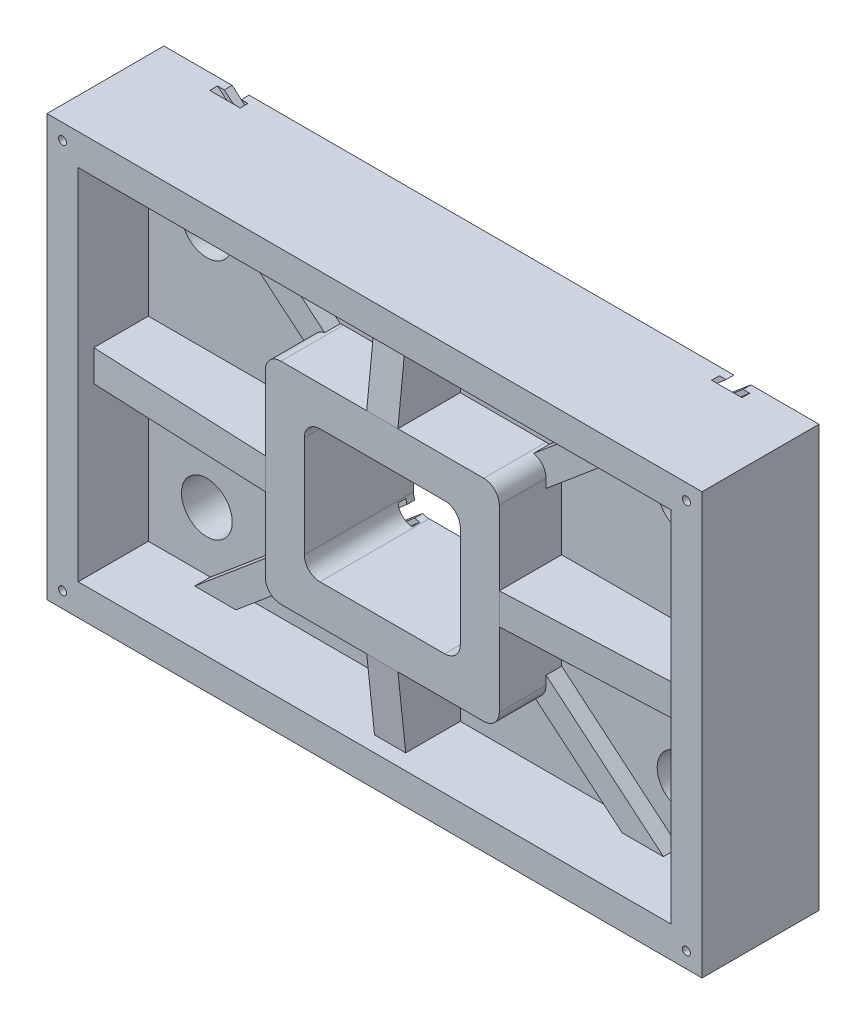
ISO-10303-21;
HEADER;
FILE_DESCRIPTION(('STEP AP214'),'2;1');
FILE_NAME('part.step','',(''),(''),'','','');
FILE_SCHEMA(('AUTOMOTIVE_DESIGN { 1 0 10303 214 1 1 1 1 }'));
ENDSEC;
DATA;
#1=APPLICATION_CONTEXT('core data for automotive mechanical design processes');
#2=APPLICATION_PROTOCOL_DEFINITION('international standard','automotive_design',2000,#1);
#3=PRODUCT_CONTEXT('',#1,'mechanical');
#4=PRODUCT('Part','Part','',(#3));
#5=PRODUCT_RELATED_PRODUCT_CATEGORY('part','',(#4));
#6=PRODUCT_DEFINITION_FORMATION('','',#4);
#7=PRODUCT_DEFINITION_CONTEXT('part definition',#1,'design');
#8=PRODUCT_DEFINITION('design','',#6,#7);
#9=PRODUCT_DEFINITION_SHAPE('','',#8);
#10=(LENGTH_UNIT() NAMED_UNIT(*) SI_UNIT(.MILLI.,.METRE.));
#11=(NAMED_UNIT(*) PLANE_ANGLE_UNIT() SI_UNIT($,.RADIAN.));
#12=(NAMED_UNIT(*) SI_UNIT($,.STERADIAN.) SOLID_ANGLE_UNIT());
#13=UNCERTAINTY_MEASURE_WITH_UNIT(LENGTH_MEASURE(1.E-05),#10,'distance_accuracy_value','');
#14=(GEOMETRIC_REPRESENTATION_CONTEXT(3) GLOBAL_UNCERTAINTY_ASSIGNED_CONTEXT((#13)) GLOBAL_UNIT_ASSIGNED_CONTEXT((#10,
#11,#12)) REPRESENTATION_CONTEXT('',''));
#15=CARTESIAN_POINT('',(0.,0.,0.));
#16=DIRECTION('',(0.,0.,1.));
#17=DIRECTION('',(1.,0.,0.));
#18=AXIS2_PLACEMENT_3D('',#15,#16,#17);
#19=CARTESIAN_POINT('',(380.,230.,60.));
#20=DIRECTION('',(0.,1.,0.));
#21=DIRECTION('',(-1.,0.,0.));
#22=AXIS2_PLACEMENT_3D('',#19,#20,#21);
#23=PLANE('',#22);
#24=DIRECTION('',(0.,0.,-1.));
#25=VECTOR('',#24,1.);
#26=CARTESIAN_POINT('',(300.550631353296,230.,80.));
#27=LINE('',#26,#25);
#28=CARTESIAN_POINT('',(300.550631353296,230.,80.));
#29=VERTEX_POINT('',#28);
#30=CARTESIAN_POINT('',(300.550631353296,230.,60.));
#31=VERTEX_POINT('',#30);
#32=EDGE_CURVE('E649',#29,#31,#27,.T.);
#33=ORIENTED_EDGE('',*,*,#32,.T.);
#34=DIRECTION('',(-1.,0.,0.));
#35=VECTOR('',#34,1.);
#36=CARTESIAN_POINT('',(380.,230.,60.));
#37=LINE('',#36,#35);
#38=CARTESIAN_POINT('',(380.,230.,60.));
#39=VERTEX_POINT('',#38);
#40=EDGE_CURVE('E1109',#39,#31,#37,.T.);
#41=ORIENTED_EDGE('',*,*,#40,.F.);
#42=DIRECTION('',(0.,0.,1.));
#43=VECTOR('',#42,1.);
#44=CARTESIAN_POINT('',(380.,230.,60.));
#45=LINE('',#44,#43);
#46=CARTESIAN_POINT('',(380.,230.,150.));
#47=VERTEX_POINT('',#46);
#48=EDGE_CURVE('E1128',#39,#47,#45,.T.);
#49=ORIENTED_EDGE('',*,*,#48,.T.);
#50=DIRECTION('',(-1.,0.,0.));
#51=VECTOR('',#50,1.);
#52=CARTESIAN_POINT('',(380.,230.,150.));
#53=LINE('',#52,#51);
#54=CARTESIAN_POINT('',(-380.,230.,150.));
#55=VERTEX_POINT('',#54);
#56=EDGE_CURVE('E1122',#47,#55,#53,.T.);
#57=ORIENTED_EDGE('',*,*,#56,.T.);
#58=DIRECTION('',(0.,0.,1.));
#59=VECTOR('',#58,1.);
#60=CARTESIAN_POINT('',(-380.,230.,60.));
#61=LINE('',#60,#59);
#62=CARTESIAN_POINT('',(-380.,230.,60.));
#63=VERTEX_POINT('',#62);
#64=EDGE_CURVE('E1125',#63,#55,#61,.T.);
#65=ORIENTED_EDGE('',*,*,#64,.F.);
#66=CARTESIAN_POINT('',(-300.5506313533,230.,60.));
#67=VERTEX_POINT('',#66);
#68=EDGE_CURVE('E1108',#67,#63,#37,.T.);
#69=ORIENTED_EDGE('',*,*,#68,.F.);
#70=DIRECTION('',(0.,0.,-1.));
#71=VECTOR('',#70,1.);
#72=CARTESIAN_POINT('',(-300.5506313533,230.,80.));
#73=LINE('',#72,#71);
#74=CARTESIAN_POINT('',(-300.5506313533,230.,80.));
#75=VERTEX_POINT('',#74);
#76=EDGE_CURVE('E664',#75,#67,#73,.T.);
#77=ORIENTED_EDGE('',*,*,#76,.F.);
#78=DIRECTION('',(-1.,0.,0.));
#79=VECTOR('',#78,1.);
#80=CARTESIAN_POINT('',(-247.656021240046,230.,80.));
#81=LINE('',#80,#79);
#82=CARTESIAN_POINT('',(-247.656021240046,230.,80.));
#83=VERTEX_POINT('',#82);
#84=EDGE_CURVE('E662',#83,#75,#81,.T.);
#85=ORIENTED_EDGE('',*,*,#84,.F.);
#86=DIRECTION('',(0.,0.,-1.));
#87=VECTOR('',#86,1.);
#88=CARTESIAN_POINT('',(-247.656021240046,230.,80.));
#89=LINE('',#88,#87);
#90=CARTESIAN_POINT('',(-247.656021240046,230.,60.));
#91=VERTEX_POINT('',#90);
#92=EDGE_CURVE('E668',#83,#91,#89,.T.);
#93=ORIENTED_EDGE('',*,*,#92,.T.);
#94=CARTESIAN_POINT('',(-20.,230.,60.));
#95=VERTEX_POINT('',#94);
#96=EDGE_CURVE('E1114',#95,#91,#37,.T.);
#97=ORIENTED_EDGE('',*,*,#96,.F.);
#98=DIRECTION('',(0.,0.,1.));
#99=VECTOR('',#98,1.);
#100=CARTESIAN_POINT('',(-20.,230.,60.));
#101=LINE('',#100,#99);
#102=CARTESIAN_POINT('',(-20.,230.,130.));
#103=VERTEX_POINT('',#102);
#104=EDGE_CURVE('E744',#95,#103,#101,.T.);
#105=ORIENTED_EDGE('',*,*,#104,.T.);
#106=DIRECTION('',(1.,0.,0.));
#107=VECTOR('',#106,1.);
#108=CARTESIAN_POINT('',(-20.,230.,130.));
#109=LINE('',#108,#107);
#110=CARTESIAN_POINT('',(20.,230.,130.));
#111=VERTEX_POINT('',#110);
#112=EDGE_CURVE('E748',#103,#111,#109,.T.);
#113=ORIENTED_EDGE('',*,*,#112,.T.);
#114=DIRECTION('',(0.,0.,1.));
#115=VECTOR('',#114,1.);
#116=CARTESIAN_POINT('',(20.,230.,60.));
#117=LINE('',#116,#115);
#118=CARTESIAN_POINT('',(20.,230.,60.));
#119=VERTEX_POINT('',#118);
#120=EDGE_CURVE('E733',#119,#111,#117,.T.);
#121=ORIENTED_EDGE('',*,*,#120,.F.);
#122=CARTESIAN_POINT('',(247.656021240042,230.,60.));
#123=VERTEX_POINT('',#122);
#124=EDGE_CURVE('E1113',#123,#119,#37,.T.);
#125=ORIENTED_EDGE('',*,*,#124,.F.);
#126=DIRECTION('',(0.,0.,-1.));
#127=VECTOR('',#126,1.);
#128=CARTESIAN_POINT('',(247.656021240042,230.,80.));
#129=LINE('',#128,#127);
#130=CARTESIAN_POINT('',(247.656021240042,230.,80.));
#131=VERTEX_POINT('',#130);
#132=EDGE_CURVE('E647',#131,#123,#129,.T.);
#133=ORIENTED_EDGE('',*,*,#132,.F.);
#134=DIRECTION('',(-1.,0.,0.));
#135=VECTOR('',#134,1.);
#136=CARTESIAN_POINT('',(300.550631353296,230.,80.));
#137=LINE('',#136,#135);
#138=EDGE_CURVE('E633',#29,#131,#137,.T.);
#139=ORIENTED_EDGE('',*,*,#138,.F.);
#140=EDGE_LOOP('',(#33,#41,#49,#57,#65,#69,#77,#85,#93,#97,#105,#113,#121,#125,#133,#139));
#141=FACE_BOUND('',#140,.T.);
#142=ADVANCED_FACE('F40',(#141),#23,.F.);
#143=CARTESIAN_POINT('',(150.,115.,140.));
#144=DIRECTION('',(-1.,0.,0.));
#145=DIRECTION('',(0.,-1.,0.));
#146=AXIS2_PLACEMENT_3D('',#143,#144,#145);
#147=PLANE('',#146);
#148=DIRECTION('',(0.,0.,-1.));
#149=VECTOR('',#148,1.);
#150=CARTESIAN_POINT('',(150.,103.673020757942,80.));
#151=LINE('',#150,#149);
#152=CARTESIAN_POINT('',(150.,103.673020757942,80.));
#153=VERTEX_POINT('',#152);
#154=CARTESIAN_POINT('',(150.,103.673020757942,60.));
#155=VERTEX_POINT('',#154);
#156=EDGE_CURVE('E642',#153,#155,#151,.T.);
#157=ORIENTED_EDGE('',*,*,#156,.F.);
#158=DIRECTION('',(0.,-1.,0.));
#159=VECTOR('',#158,1.);
#160=CARTESIAN_POINT('',(150.,103.673020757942,80.));
#161=LINE('',#160,#159);
#162=CARTESIAN_POINT('',(150.,115.,80.));
#163=VERTEX_POINT('',#162);
#164=EDGE_CURVE('E640',#163,#153,#161,.T.);
#165=ORIENTED_EDGE('',*,*,#164,.F.);
#166=DIRECTION('',(0.,0.,-1.));
#167=VECTOR('',#166,1.);
#168=CARTESIAN_POINT('',(150.,115.,140.));
#169=LINE('',#168,#167);
#170=CARTESIAN_POINT('',(150.,115.,140.));
#171=VERTEX_POINT('',#170);
#172=EDGE_CURVE('E919',#171,#163,#169,.T.);
#173=ORIENTED_EDGE('',*,*,#172,.F.);
#174=DIRECTION('',(0.,1.,0.));
#175=VECTOR('',#174,1.);
#176=CARTESIAN_POINT('',(150.,115.,140.));
#177=LINE('',#176,#175);
#178=CARTESIAN_POINT('',(150.,20.,140.));
#179=VERTEX_POINT('',#178);
#180=EDGE_CURVE('E869',#179,#171,#177,.T.);
#181=ORIENTED_EDGE('',*,*,#180,.F.);
#182=DIRECTION('',(0.,0.,1.));
#183=VECTOR('',#182,1.);
#184=CARTESIAN_POINT('',(150.,20.,140.));
#185=LINE('',#184,#183);
#186=CARTESIAN_POINT('',(150.,20.,60.));
#187=VERTEX_POINT('',#186);
#188=EDGE_CURVE('E816',#187,#179,#185,.T.);
#189=ORIENTED_EDGE('',*,*,#188,.F.);
#190=DIRECTION('',(0.,1.,0.));
#191=VECTOR('',#190,1.);
#192=CARTESIAN_POINT('',(150.,115.,60.));
#193=LINE('',#192,#191);
#194=EDGE_CURVE('E894',#187,#155,#193,.T.);
#195=ORIENTED_EDGE('',*,*,#194,.T.);
#196=EDGE_LOOP('',(#157,#165,#173,#181,#189,#195));
#197=FACE_BOUND('',#196,.T.);
#198=ADVANCED_FACE('F1356',(#197),#147,.F.);
#199=CARTESIAN_POINT('',(0.,0.,60.));
#200=DIRECTION('',(0.,0.,-1.));
#201=DIRECTION('',(-1.,0.,0.));
#202=AXIS2_PLACEMENT_3D('',#199,#200,#201);
#203=PLANE('',#202);
#204=CARTESIAN_POINT('',(305.,155.,60.));
#205=DIRECTION('',(0.,0.,-1.));
#206=DIRECTION('',(-1.,0.,0.));
#207=AXIS2_PLACEMENT_3D('',#204,#205,#206);
#208=CIRCLE('',#207,32.5);
#209=CARTESIAN_POINT('',(272.5,155.,60.));
#210=VERTEX_POINT('',#209);
#211=EDGE_CURVE('E1140',#210,#210,#208,.T.);
#212=ORIENTED_EDGE('',*,*,#211,.T.);
#213=EDGE_LOOP('',(#212));
#214=FACE_BOUND('',#213,.T.);
#215=DIRECTION('',(0.766044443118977,0.642787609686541,0.));
#216=VECTOR('',#215,1.);
#217=CARTESIAN_POINT('',(150.,103.673020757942,60.));
#218=LINE('',#217,#216);
#219=EDGE_CURVE('E630',#155,#31,#218,.T.);
#220=ORIENTED_EDGE('',*,*,#219,.F.);
#221=ORIENTED_EDGE('',*,*,#194,.F.);
#222=DIRECTION('',(-1.,0.,0.));
#223=VECTOR('',#222,1.);
#224=CARTESIAN_POINT('',(380.,20.,60.));
#225=LINE('',#224,#223);
#226=CARTESIAN_POINT('',(380.,20.,60.));
#227=VERTEX_POINT('',#226);
#228=EDGE_CURVE('E813',#227,#187,#225,.T.);
#229=ORIENTED_EDGE('',*,*,#228,.F.);
#230=DIRECTION('',(0.,1.,0.));
#231=VECTOR('',#230,1.);
#232=CARTESIAN_POINT('',(380.,230.,60.));
#233=LINE('',#232,#231);
#234=EDGE_CURVE('E1102',#227,#39,#233,.T.);
#235=ORIENTED_EDGE('',*,*,#234,.T.);
#236=ORIENTED_EDGE('',*,*,#40,.T.);
#237=EDGE_LOOP('',(#220,#221,#229,#235,#236));
#238=FACE_BOUND('',#237,.T.);
#239=ADVANCED_FACE('F1362',(#214,#238),#203,.F.);
#240=DIRECTION('',(-0.766044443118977,-0.642787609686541,0.));
#241=VECTOR('',#240,1.);
#242=CARTESIAN_POINT('',(133.966079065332,134.602811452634,60.));
#243=LINE('',#242,#241);
#244=CARTESIAN_POINT('',(133.966079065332,134.602811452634,60.));
#245=VERTEX_POINT('',#244);
#246=EDGE_CURVE('E634',#123,#245,#243,.T.);
#247=ORIENTED_EDGE('',*,*,#246,.F.);
#248=ORIENTED_EDGE('',*,*,#124,.T.);
#249=DIRECTION('',(0.,1.,0.));
#250=VECTOR('',#249,1.);
#251=CARTESIAN_POINT('',(20.,135.,60.));
#252=LINE('',#251,#250);
#253=CARTESIAN_POINT('',(20.,135.,60.));
#254=VERTEX_POINT('',#253);
#255=EDGE_CURVE('E730',#254,#119,#252,.T.);
#256=ORIENTED_EDGE('',*,*,#255,.F.);
#257=DIRECTION('',(-1.,0.,0.));
#258=VECTOR('',#257,1.);
#259=CARTESIAN_POINT('',(130.,135.,60.));
#260=LINE('',#259,#258);
#261=CARTESIAN_POINT('',(130.,135.,60.));
#262=VERTEX_POINT('',#261);
#263=EDGE_CURVE('E900',#262,#254,#260,.T.);
#264=ORIENTED_EDGE('',*,*,#263,.F.);
#265=CARTESIAN_POINT('',(130.,115.,60.));
#266=DIRECTION('',(0.,0.,1.));
#267=DIRECTION('',(-1.,0.,0.));
#268=AXIS2_PLACEMENT_3D('',#265,#266,#267);
#269=CIRCLE('',#268,20.);
#270=EDGE_CURVE('E897',#245,#262,#269,.T.);
#271=ORIENTED_EDGE('',*,*,#270,.F.);
#272=EDGE_LOOP('',(#247,#248,#256,#264,#271));
#273=FACE_BOUND('',#272,.T.);
#274=ADVANCED_FACE('F2180',(#273),#203,.F.);
#275=CARTESIAN_POINT('',(130.,115.,140.));
#276=DIRECTION('',(0.,0.,-1.));
#277=DIRECTION('',(-1.,0.,0.));
#278=AXIS2_PLACEMENT_3D('',#275,#276,#277);
#279=CYLINDRICAL_SURFACE('',#278,20.);
#280=DIRECTION('',(0.,0.,-1.));
#281=VECTOR('',#280,1.);
#282=CARTESIAN_POINT('',(133.966079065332,134.602811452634,80.));
#283=LINE('',#282,#281);
#284=CARTESIAN_POINT('',(133.966079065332,134.602811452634,80.));
#285=VERTEX_POINT('',#284);
#286=EDGE_CURVE('E55',#285,#245,#283,.T.);
#287=ORIENTED_EDGE('',*,*,#286,.T.);
#288=ORIENTED_EDGE('',*,*,#270,.T.);
#289=DIRECTION('',(0.,0.,-1.));
#290=VECTOR('',#289,1.);
#291=CARTESIAN_POINT('',(130.,135.,140.));
#292=LINE('',#291,#290);
#293=CARTESIAN_POINT('',(130.,135.,140.));
#294=VERTEX_POINT('',#293);
#295=EDGE_CURVE('E916',#294,#262,#292,.T.);
#296=ORIENTED_EDGE('',*,*,#295,.F.);
#297=CARTESIAN_POINT('',(130.,115.,140.));
#298=DIRECTION('',(0.,0.,1.));
#299=DIRECTION('',(-1.,0.,0.));
#300=AXIS2_PLACEMENT_3D('',#297,#298,#299);
#301=CIRCLE('',#300,20.);
#302=EDGE_CURVE('E873',#171,#294,#301,.T.);
#303=ORIENTED_EDGE('',*,*,#302,.F.);
#304=ORIENTED_EDGE('',*,*,#172,.T.);
#305=CARTESIAN_POINT('',(130.,115.,80.));
#306=DIRECTION('',(0.,0.,-1.));
#307=DIRECTION('',(1.,0.,0.));
#308=AXIS2_PLACEMENT_3D('',#305,#306,#307);
#309=CIRCLE('',#308,20.);
#310=EDGE_CURVE('E638',#285,#163,#309,.T.);
#311=ORIENTED_EDGE('',*,*,#310,.F.);
#312=EDGE_LOOP('',(#287,#288,#296,#303,#304,#311));
#313=FACE_BOUND('',#312,.T.);
#314=ADVANCED_FACE('F2189',(#313),#279,.T.);
#315=CARTESIAN_POINT('',(-305.,155.,60.));
#316=DIRECTION('',(0.,0.,-1.));
#317=DIRECTION('',(-1.,0.,0.));
#318=AXIS2_PLACEMENT_3D('',#315,#316,#317);
#319=CIRCLE('',#318,32.5);
#320=CARTESIAN_POINT('',(-337.5,155.,60.));
#321=VERTEX_POINT('',#320);
#322=EDGE_CURVE('E1137',#321,#321,#319,.T.);
#323=ORIENTED_EDGE('',*,*,#322,.T.);
#324=EDGE_LOOP('',(#323));
#325=FACE_BOUND('',#324,.T.);
#326=DIRECTION('',(0.766044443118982,-0.642787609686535,0.));
#327=VECTOR('',#326,1.);
#328=CARTESIAN_POINT('',(-150.,103.673020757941,60.));
#329=LINE('',#328,#327);
#330=CARTESIAN_POINT('',(-150.,103.673020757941,60.));
#331=VERTEX_POINT('',#330);
#332=EDGE_CURVE('E652',#67,#331,#329,.T.);
#333=ORIENTED_EDGE('',*,*,#332,.F.);
#334=ORIENTED_EDGE('',*,*,#68,.T.);
#335=DIRECTION('',(0.,-1.,0.));
#336=VECTOR('',#335,1.);
#337=CARTESIAN_POINT('',(-380.,230.,60.));
#338=LINE('',#337,#336);
#339=CARTESIAN_POINT('',(-380.,20.,60.));
#340=VERTEX_POINT('',#339);
#341=EDGE_CURVE('E1094',#63,#340,#338,.T.);
#342=ORIENTED_EDGE('',*,*,#341,.T.);
#343=DIRECTION('',(-1.,0.,0.));
#344=VECTOR('',#343,1.);
#345=CARTESIAN_POINT('',(-150.,20.,60.));
#346=LINE('',#345,#344);
#347=CARTESIAN_POINT('',(-150.,20.,60.));
#348=VERTEX_POINT('',#347);
#349=EDGE_CURVE('E785',#348,#340,#346,.T.);
#350=ORIENTED_EDGE('',*,*,#349,.F.);
#351=DIRECTION('',(0.,-1.,0.));
#352=VECTOR('',#351,1.);
#353=CARTESIAN_POINT('',(-150.,115.,60.));
#354=LINE('',#353,#352);
#355=EDGE_CURVE('E863',#331,#348,#354,.T.);
#356=ORIENTED_EDGE('',*,*,#355,.F.);
#357=EDGE_LOOP('',(#333,#334,#342,#350,#356));
#358=FACE_BOUND('',#357,.T.);
#359=ADVANCED_FACE('F2191',(#325,#358),#203,.F.);
#360=DIRECTION('',(-0.766044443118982,0.642787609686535,0.));
#361=VECTOR('',#360,1.);
#362=CARTESIAN_POINT('',(-133.966079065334,134.602811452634,60.));
#363=LINE('',#362,#361);
#364=CARTESIAN_POINT('',(-133.966079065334,134.602811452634,60.));
#365=VERTEX_POINT('',#364);
#366=EDGE_CURVE('E656',#365,#91,#363,.T.);
#367=ORIENTED_EDGE('',*,*,#366,.F.);
#368=CARTESIAN_POINT('',(-130.,115.,60.));
#369=DIRECTION('',(0.,0.,1.));
#370=DIRECTION('',(-1.,0.,0.));
#371=AXIS2_PLACEMENT_3D('',#368,#369,#370);
#372=CIRCLE('',#371,20.);
#373=CARTESIAN_POINT('',(-130.,135.,60.));
#374=VERTEX_POINT('',#373);
#375=EDGE_CURVE('E903',#374,#365,#372,.T.);
#376=ORIENTED_EDGE('',*,*,#375,.F.);
#377=CARTESIAN_POINT('',(-20.,135.,60.));
#378=VERTEX_POINT('',#377);
#379=EDGE_CURVE('E899',#378,#374,#260,.T.);
#380=ORIENTED_EDGE('',*,*,#379,.F.);
#381=DIRECTION('',(0.,1.,0.));
#382=VECTOR('',#381,1.);
#383=CARTESIAN_POINT('',(-20.,135.,60.));
#384=LINE('',#383,#382);
#385=EDGE_CURVE('E741',#378,#95,#384,.T.);
#386=ORIENTED_EDGE('',*,*,#385,.T.);
#387=ORIENTED_EDGE('',*,*,#96,.T.);
#388=EDGE_LOOP('',(#367,#376,#380,#386,#387));
#389=FACE_BOUND('',#388,.T.);
#390=ADVANCED_FACE('F2206',(#389),#203,.F.);
#391=CARTESIAN_POINT('',(-130.,115.,140.));
#392=DIRECTION('',(0.,0.,-1.));
#393=DIRECTION('',(-1.,0.,0.));
#394=AXIS2_PLACEMENT_3D('',#391,#392,#393);
#395=CYLINDRICAL_SURFACE('',#394,20.);
#396=DIRECTION('',(0.,0.,-1.));
#397=VECTOR('',#396,1.);
#398=CARTESIAN_POINT('',(-133.966079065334,134.602811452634,80.));
#399=LINE('',#398,#397);
#400=CARTESIAN_POINT('',(-133.966079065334,134.602811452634,80.));
#401=VERTEX_POINT('',#400);
#402=EDGE_CURVE('E671',#401,#365,#399,.T.);
#403=ORIENTED_EDGE('',*,*,#402,.F.);
#404=CARTESIAN_POINT('',(-130.,115.,80.));
#405=DIRECTION('',(0.,0.,-1.));
#406=DIRECTION('',(1.,0.,0.));
#407=AXIS2_PLACEMENT_3D('',#404,#405,#406);
#408=CIRCLE('',#407,20.);
#409=CARTESIAN_POINT('',(-150.,115.,80.));
#410=VERTEX_POINT('',#409);
#411=EDGE_CURVE('E658',#410,#401,#408,.T.);
#412=ORIENTED_EDGE('',*,*,#411,.F.);
#413=DIRECTION('',(0.,0.,-1.));
#414=VECTOR('',#413,1.);
#415=CARTESIAN_POINT('',(-150.,115.,140.));
#416=LINE('',#415,#414);
#417=CARTESIAN_POINT('',(-150.,115.,140.));
#418=VERTEX_POINT('',#417);
#419=EDGE_CURVE('E910',#418,#410,#416,.T.);
#420=ORIENTED_EDGE('',*,*,#419,.F.);
#421=CARTESIAN_POINT('',(-130.,115.,140.));
#422=DIRECTION('',(0.,0.,1.));
#423=DIRECTION('',(-1.,0.,0.));
#424=AXIS2_PLACEMENT_3D('',#421,#422,#423);
#425=CIRCLE('',#424,20.);
#426=CARTESIAN_POINT('',(-130.,135.,140.));
#427=VERTEX_POINT('',#426);
#428=EDGE_CURVE('E879',#427,#418,#425,.T.);
#429=ORIENTED_EDGE('',*,*,#428,.F.);
#430=DIRECTION('',(0.,0.,-1.));
#431=VECTOR('',#430,1.);
#432=CARTESIAN_POINT('',(-130.,135.,140.));
#433=LINE('',#432,#431);
#434=EDGE_CURVE('E913',#427,#374,#433,.T.);
#435=ORIENTED_EDGE('',*,*,#434,.T.);
#436=ORIENTED_EDGE('',*,*,#375,.T.);
#437=EDGE_LOOP('',(#403,#412,#420,#429,#435,#436));
#438=FACE_BOUND('',#437,.T.);
#439=ADVANCED_FACE('F2214',(#438),#395,.T.);
#440=CARTESIAN_POINT('',(-150.,115.,140.));
#441=DIRECTION('',(1.,0.,0.));
#442=DIRECTION('',(0.,1.,0.));
#443=AXIS2_PLACEMENT_3D('',#440,#441,#442);
#444=PLANE('',#443);
#445=DIRECTION('',(0.,0.,-1.));
#446=VECTOR('',#445,1.);
#447=CARTESIAN_POINT('',(-150.,103.673020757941,80.));
#448=LINE('',#447,#446);
#449=CARTESIAN_POINT('',(-150.,103.673020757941,80.));
#450=VERTEX_POINT('',#449);
#451=EDGE_CURVE('E63',#450,#331,#448,.T.);
#452=ORIENTED_EDGE('',*,*,#451,.T.);
#453=ORIENTED_EDGE('',*,*,#355,.T.);
#454=DIRECTION('',(0.,0.,-1.));
#455=VECTOR('',#454,1.);
#456=CARTESIAN_POINT('',(-150.,20.,140.));
#457=LINE('',#456,#455);
#458=CARTESIAN_POINT('',(-150.,20.,140.));
#459=VERTEX_POINT('',#458);
#460=EDGE_CURVE('E782',#459,#348,#457,.T.);
#461=ORIENTED_EDGE('',*,*,#460,.F.);
#462=DIRECTION('',(0.,-1.,0.));
#463=VECTOR('',#462,1.);
#464=CARTESIAN_POINT('',(-150.,115.,140.));
#465=LINE('',#464,#463);
#466=EDGE_CURVE('E882',#418,#459,#465,.T.);
#467=ORIENTED_EDGE('',*,*,#466,.F.);
#468=ORIENTED_EDGE('',*,*,#419,.T.);
#469=DIRECTION('',(0.,1.,0.));
#470=VECTOR('',#469,1.);
#471=CARTESIAN_POINT('',(-150.,115.,80.));
#472=LINE('',#471,#470);
#473=EDGE_CURVE('E655',#450,#410,#472,.T.);
#474=ORIENTED_EDGE('',*,*,#473,.F.);
#475=EDGE_LOOP('',(#452,#453,#461,#467,#468,#474));
#476=FACE_BOUND('',#475,.T.);
#477=ADVANCED_FACE('F1379',(#476),#444,.F.);
#478=CARTESIAN_POINT('',(380.,-230.,60.));
#479=DIRECTION('',(0.,-1.,0.));
#480=DIRECTION('',(1.,0.,0.));
#481=AXIS2_PLACEMENT_3D('',#478,#479,#480);
#482=PLANE('',#481);
#483=DIRECTION('',(0.,0.,-1.));
#484=VECTOR('',#483,1.);
#485=CARTESIAN_POINT('',(-300.550631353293,-230.,80.));
#486=LINE('',#485,#484);
#487=CARTESIAN_POINT('',(-300.550631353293,-230.,80.));
#488=VERTEX_POINT('',#487);
#489=CARTESIAN_POINT('',(-300.550631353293,-230.,60.));
#490=VERTEX_POINT('',#489);
#491=EDGE_CURVE('E695',#488,#490,#486,.T.);
#492=ORIENTED_EDGE('',*,*,#491,.T.);
#493=DIRECTION('',(1.,0.,0.));
#494=VECTOR('',#493,1.);
#495=CARTESIAN_POINT('',(380.,-230.,60.));
#496=LINE('',#495,#494);
#497=CARTESIAN_POINT('',(-380.,-230.,60.));
#498=VERTEX_POINT('',#497);
#499=EDGE_CURVE('E1099',#498,#490,#496,.T.);
#500=ORIENTED_EDGE('',*,*,#499,.F.);
#501=DIRECTION('',(0.,0.,1.));
#502=VECTOR('',#501,1.);
#503=CARTESIAN_POINT('',(-380.,-230.,60.));
#504=LINE('',#503,#502);
#505=CARTESIAN_POINT('',(-380.,-230.,150.));
#506=VERTEX_POINT('',#505);
#507=EDGE_CURVE('E1112',#498,#506,#504,.T.);
#508=ORIENTED_EDGE('',*,*,#507,.T.);
#509=DIRECTION('',(1.,0.,0.));
#510=VECTOR('',#509,1.);
#511=CARTESIAN_POINT('',(380.,-230.,150.));
#512=LINE('',#511,#510);
#513=CARTESIAN_POINT('',(380.,-230.,150.));
#514=VERTEX_POINT('',#513);
#515=EDGE_CURVE('E1116',#506,#514,#512,.T.);
#516=ORIENTED_EDGE('',*,*,#515,.T.);
#517=DIRECTION('',(0.,0.,1.));
#518=VECTOR('',#517,1.);
#519=CARTESIAN_POINT('',(380.,-230.,60.));
#520=LINE('',#519,#518);
#521=CARTESIAN_POINT('',(380.,-230.,60.));
#522=VERTEX_POINT('',#521);
#523=EDGE_CURVE('E1130',#522,#514,#520,.T.);
#524=ORIENTED_EDGE('',*,*,#523,.F.);
#525=CARTESIAN_POINT('',(300.550631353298,-230.,60.));
#526=VERTEX_POINT('',#525);
#527=EDGE_CURVE('E1097',#526,#522,#496,.T.);
#528=ORIENTED_EDGE('',*,*,#527,.F.);
#529=DIRECTION('',(0.,0.,-1.));
#530=VECTOR('',#529,1.);
#531=CARTESIAN_POINT('',(300.550631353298,-230.,80.));
#532=LINE('',#531,#530);
#533=CARTESIAN_POINT('',(300.550631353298,-230.,80.));
#534=VERTEX_POINT('',#533);
#535=EDGE_CURVE('E724',#534,#526,#532,.T.);
#536=ORIENTED_EDGE('',*,*,#535,.F.);
#537=DIRECTION('',(1.,0.,0.));
#538=VECTOR('',#537,1.);
#539=CARTESIAN_POINT('',(247.656021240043,-230.,80.));
#540=LINE('',#539,#538);
#541=CARTESIAN_POINT('',(247.656021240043,-230.,80.));
#542=VERTEX_POINT('',#541);
#543=EDGE_CURVE('E701',#542,#534,#540,.T.);
#544=ORIENTED_EDGE('',*,*,#543,.F.);
#545=DIRECTION('',(0.,0.,-1.));
#546=VECTOR('',#545,1.);
#547=CARTESIAN_POINT('',(247.656021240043,-230.,80.));
#548=LINE('',#547,#546);
#549=CARTESIAN_POINT('',(247.656021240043,-230.,60.));
#550=VERTEX_POINT('',#549);
#551=EDGE_CURVE('E714',#542,#550,#548,.T.);
#552=ORIENTED_EDGE('',*,*,#551,.T.);
#553=CARTESIAN_POINT('',(20.,-230.,60.));
#554=VERTEX_POINT('',#553);
#555=EDGE_CURVE('E1104',#554,#550,#496,.T.);
#556=ORIENTED_EDGE('',*,*,#555,.F.);
#557=DIRECTION('',(0.,0.,-1.));
#558=VECTOR('',#557,1.);
#559=CARTESIAN_POINT('',(20.,-230.,60.));
#560=LINE('',#559,#558);
#561=CARTESIAN_POINT('',(20.,-230.,130.));
#562=VERTEX_POINT('',#561);
#563=EDGE_CURVE('E756',#562,#554,#560,.T.);
#564=ORIENTED_EDGE('',*,*,#563,.F.);
#565=DIRECTION('',(1.,0.,0.));
#566=VECTOR('',#565,1.);
#567=CARTESIAN_POINT('',(-20.,-230.,130.));
#568=LINE('',#567,#566);
#569=CARTESIAN_POINT('',(-20.,-230.,130.));
#570=VERTEX_POINT('',#569);
#571=EDGE_CURVE('E775',#570,#562,#568,.T.);
#572=ORIENTED_EDGE('',*,*,#571,.F.);
#573=DIRECTION('',(0.,0.,-1.));
#574=VECTOR('',#573,1.);
#575=CARTESIAN_POINT('',(-20.,-230.,60.));
#576=LINE('',#575,#574);
#577=CARTESIAN_POINT('',(-20.,-230.,60.));
#578=VERTEX_POINT('',#577);
#579=EDGE_CURVE('E768',#570,#578,#576,.T.);
#580=ORIENTED_EDGE('',*,*,#579,.T.);
#581=CARTESIAN_POINT('',(-247.656021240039,-230.,60.));
#582=VERTEX_POINT('',#581);
#583=EDGE_CURVE('E1103',#582,#578,#496,.T.);
#584=ORIENTED_EDGE('',*,*,#583,.F.);
#585=DIRECTION('',(0.,0.,-1.));
#586=VECTOR('',#585,1.);
#587=CARTESIAN_POINT('',(-247.656021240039,-230.,80.));
#588=LINE('',#587,#586);
#589=CARTESIAN_POINT('',(-247.656021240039,-230.,80.));
#590=VERTEX_POINT('',#589);
#591=EDGE_CURVE('E693',#590,#582,#588,.T.);
#592=ORIENTED_EDGE('',*,*,#591,.F.);
#593=DIRECTION('',(1.,0.,0.));
#594=VECTOR('',#593,1.);
#595=CARTESIAN_POINT('',(-300.550631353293,-230.,80.));
#596=LINE('',#595,#594);
#597=EDGE_CURVE('E681',#488,#590,#596,.T.);
#598=ORIENTED_EDGE('',*,*,#597,.F.);
#599=EDGE_LOOP('',(#492,#500,#508,#516,#524,#528,#536,#544,#552,#556,#564,#572,#580,#584,#592,#598));
#600=FACE_BOUND('',#599,.T.);
#601=ADVANCED_FACE('F1375',(#600),#482,.F.);
#602=CARTESIAN_POINT('',(-305.,-155.,60.));
#603=DIRECTION('',(0.,0.,-1.));
#604=DIRECTION('',(-1.,0.,0.));
#605=AXIS2_PLACEMENT_3D('',#602,#603,#604);
#606=CIRCLE('',#605,32.5);
#607=CARTESIAN_POINT('',(-337.5,-155.,60.));
#608=VERTEX_POINT('',#607);
#609=EDGE_CURVE('E1127',#608,#608,#606,.T.);
#610=ORIENTED_EDGE('',*,*,#609,.T.);
#611=EDGE_LOOP('',(#610));
#612=FACE_BOUND('',#611,.T.);
#613=DIRECTION('',(-0.766044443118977,-0.642787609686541,0.));
#614=VECTOR('',#613,1.);
#615=CARTESIAN_POINT('',(-300.550631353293,-230.,60.));
#616=LINE('',#615,#614);
#617=CARTESIAN_POINT('',(-150.,-103.673020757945,60.));
#618=VERTEX_POINT('',#617);
#619=EDGE_CURVE('E674',#618,#490,#616,.T.);
#620=ORIENTED_EDGE('',*,*,#619,.F.);
#621=CARTESIAN_POINT('',(-150.,-20.,60.));
#622=VERTEX_POINT('',#621);
#623=EDGE_CURVE('E906',#622,#618,#354,.T.);
#624=ORIENTED_EDGE('',*,*,#623,.F.);
#625=DIRECTION('',(-1.,0.,0.));
#626=VECTOR('',#625,1.);
#627=CARTESIAN_POINT('',(-150.,-20.,60.));
#628=LINE('',#627,#626);
#629=CARTESIAN_POINT('',(-380.,-20.,60.));
#630=VERTEX_POINT('',#629);
#631=EDGE_CURVE('E795',#622,#630,#628,.T.);
#632=ORIENTED_EDGE('',*,*,#631,.T.);
#633=EDGE_CURVE('E1098',#630,#498,#338,.T.);
#634=ORIENTED_EDGE('',*,*,#633,.T.);
#635=ORIENTED_EDGE('',*,*,#499,.T.);
#636=EDGE_LOOP('',(#620,#624,#632,#634,#635));
#637=FACE_BOUND('',#636,.T.);
#638=ADVANCED_FACE('F1378',(#612,#637),#203,.F.);
#639=DIRECTION('',(0.766044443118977,0.64278760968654,0.));
#640=VECTOR('',#639,1.);
#641=CARTESIAN_POINT('',(-247.656021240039,-230.,60.));
#642=LINE('',#641,#640);
#643=CARTESIAN_POINT('',(-133.96607906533,-134.602811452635,60.));
#644=VERTEX_POINT('',#643);
#645=EDGE_CURVE('E679',#582,#644,#642,.T.);
#646=ORIENTED_EDGE('',*,*,#645,.F.);
#647=ORIENTED_EDGE('',*,*,#583,.T.);
#648=DIRECTION('',(0.,1.,0.));
#649=VECTOR('',#648,1.);
#650=CARTESIAN_POINT('',(-20.,-230.,60.));
#651=LINE('',#650,#649);
#652=CARTESIAN_POINT('',(-20.,-135.,60.));
#653=VERTEX_POINT('',#652);
#654=EDGE_CURVE('E771',#578,#653,#651,.T.);
#655=ORIENTED_EDGE('',*,*,#654,.T.);
#656=DIRECTION('',(1.,0.,0.));
#657=VECTOR('',#656,1.);
#658=CARTESIAN_POINT('',(130.,-135.,60.));
#659=LINE('',#658,#657);
#660=CARTESIAN_POINT('',(-130.,-135.,60.));
#661=VERTEX_POINT('',#660);
#662=EDGE_CURVE('E888',#661,#653,#659,.T.);
#663=ORIENTED_EDGE('',*,*,#662,.F.);
#664=CARTESIAN_POINT('',(-130.,-115.,60.));
#665=DIRECTION('',(0.,0.,1.));
#666=DIRECTION('',(1.,0.,0.));
#667=AXIS2_PLACEMENT_3D('',#664,#665,#666);
#668=CIRCLE('',#667,20.);
#669=EDGE_CURVE('E858',#644,#661,#668,.T.);
#670=ORIENTED_EDGE('',*,*,#669,.F.);
#671=EDGE_LOOP('',(#646,#647,#655,#663,#670));
#672=FACE_BOUND('',#671,.T.);
#673=ADVANCED_FACE('F2244',(#672),#203,.F.);
#674=DIRECTION('',(0.,0.,-1.));
#675=VECTOR('',#674,1.);
#676=CARTESIAN_POINT('',(-150.,-103.673020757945,80.));
#677=LINE('',#676,#675);
#678=CARTESIAN_POINT('',(-150.,-103.673020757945,80.));
#679=VERTEX_POINT('',#678);
#680=EDGE_CURVE('E698',#679,#618,#677,.T.);
#681=ORIENTED_EDGE('',*,*,#680,.F.);
#682=DIRECTION('',(0.,1.,0.));
#683=VECTOR('',#682,1.);
#684=CARTESIAN_POINT('',(-150.,-103.673020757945,80.));
#685=LINE('',#684,#683);
#686=CARTESIAN_POINT('',(-150.,-115.,80.));
#687=VERTEX_POINT('',#686);
#688=EDGE_CURVE('E675',#687,#679,#685,.T.);
#689=ORIENTED_EDGE('',*,*,#688,.F.);
#690=DIRECTION('',(0.,0.,-1.));
#691=VECTOR('',#690,1.);
#692=CARTESIAN_POINT('',(-150.,-115.,140.));
#693=LINE('',#692,#691);
#694=CARTESIAN_POINT('',(-150.,-115.,140.));
#695=VERTEX_POINT('',#694);
#696=EDGE_CURVE('E885',#695,#687,#693,.T.);
#697=ORIENTED_EDGE('',*,*,#696,.F.);
#698=CARTESIAN_POINT('',(-150.,-20.,140.));
#699=VERTEX_POINT('',#698);
#700=EDGE_CURVE('E881',#699,#695,#465,.T.);
#701=ORIENTED_EDGE('',*,*,#700,.F.);
#702=DIRECTION('',(0.,0.,-1.));
#703=VECTOR('',#702,1.);
#704=CARTESIAN_POINT('',(-150.,-20.,140.));
#705=LINE('',#704,#703);
#706=EDGE_CURVE('E792',#699,#622,#705,.T.);
#707=ORIENTED_EDGE('',*,*,#706,.T.);
#708=ORIENTED_EDGE('',*,*,#623,.T.);
#709=EDGE_LOOP('',(#681,#689,#697,#701,#707,#708));
#710=FACE_BOUND('',#709,.T.);
#711=ADVANCED_FACE('F2232',(#710),#444,.F.);
#712=CARTESIAN_POINT('',(-130.,-115.,140.));
#713=DIRECTION('',(0.,0.,-1.));
#714=DIRECTION('',(-1.,0.,0.));
#715=AXIS2_PLACEMENT_3D('',#712,#713,#714);
#716=CYLINDRICAL_SURFACE('',#715,20.);
#717=DIRECTION('',(0.,0.,-1.));
#718=VECTOR('',#717,1.);
#719=CARTESIAN_POINT('',(-133.96607906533,-134.602811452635,80.));
#720=LINE('',#719,#718);
#721=CARTESIAN_POINT('',(-133.96607906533,-134.602811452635,80.));
#722=VERTEX_POINT('',#721);
#723=EDGE_CURVE('E688',#722,#644,#720,.T.);
#724=ORIENTED_EDGE('',*,*,#723,.T.);
#725=ORIENTED_EDGE('',*,*,#669,.T.);
#726=DIRECTION('',(0.,0.,-1.));
#727=VECTOR('',#726,1.);
#728=CARTESIAN_POINT('',(-130.,-135.,140.));
#729=LINE('',#728,#727);
#730=CARTESIAN_POINT('',(-130.,-135.,140.));
#731=VERTEX_POINT('',#730);
#732=EDGE_CURVE('E928',#731,#661,#729,.T.);
#733=ORIENTED_EDGE('',*,*,#732,.F.);
#734=CARTESIAN_POINT('',(-130.,-115.,140.));
#735=DIRECTION('',(0.,0.,1.));
#736=DIRECTION('',(1.,0.,0.));
#737=AXIS2_PLACEMENT_3D('',#734,#735,#736);
#738=CIRCLE('',#737,20.);
#739=EDGE_CURVE('E859',#695,#731,#738,.T.);
#740=ORIENTED_EDGE('',*,*,#739,.F.);
#741=ORIENTED_EDGE('',*,*,#696,.T.);
#742=CARTESIAN_POINT('',(-130.,-115.,80.));
#743=DIRECTION('',(0.,0.,-1.));
#744=DIRECTION('',(1.,0.,0.));
#745=AXIS2_PLACEMENT_3D('',#742,#743,#744);
#746=CIRCLE('',#745,20.);
#747=EDGE_CURVE('E686',#722,#687,#746,.T.);
#748=ORIENTED_EDGE('',*,*,#747,.F.);
#749=EDGE_LOOP('',(#724,#725,#733,#740,#741,#748));
#750=FACE_BOUND('',#749,.T.);
#751=ADVANCED_FACE('F2260',(#750),#716,.T.);
#752=CARTESIAN_POINT('',(305.,-155.,60.));
#753=DIRECTION('',(0.,0.,-1.));
#754=DIRECTION('',(-1.,0.,0.));
#755=AXIS2_PLACEMENT_3D('',#752,#753,#754);
#756=CIRCLE('',#755,32.5);
#757=CARTESIAN_POINT('',(272.5,-155.,60.));
#758=VERTEX_POINT('',#757);
#759=EDGE_CURVE('E1134',#758,#758,#756,.T.);
#760=ORIENTED_EDGE('',*,*,#759,.T.);
#761=EDGE_LOOP('',(#760));
#762=FACE_BOUND('',#761,.T.);
#763=DIRECTION('',(-0.766044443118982,0.642787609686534,0.));
#764=VECTOR('',#763,1.);
#765=CARTESIAN_POINT('',(300.550631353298,-230.,60.));
#766=LINE('',#765,#764);
#767=CARTESIAN_POINT('',(150.,-103.673020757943,60.));
#768=VERTEX_POINT('',#767);
#769=EDGE_CURVE('E700',#526,#768,#766,.T.);
#770=ORIENTED_EDGE('',*,*,#769,.F.);
#771=ORIENTED_EDGE('',*,*,#527,.T.);
#772=CARTESIAN_POINT('',(380.,-20.,60.));
#773=VERTEX_POINT('',#772);
#774=EDGE_CURVE('E1105',#522,#773,#233,.T.);
#775=ORIENTED_EDGE('',*,*,#774,.T.);
#776=DIRECTION('',(-1.,0.,0.));
#777=VECTOR('',#776,1.);
#778=CARTESIAN_POINT('',(380.,-20.,60.));
#779=LINE('',#778,#777);
#780=CARTESIAN_POINT('',(150.,-20.,60.));
#781=VERTEX_POINT('',#780);
#782=EDGE_CURVE('E824',#773,#781,#779,.T.);
#783=ORIENTED_EDGE('',*,*,#782,.T.);
#784=EDGE_CURVE('E895',#768,#781,#193,.T.);
#785=ORIENTED_EDGE('',*,*,#784,.F.);
#786=EDGE_LOOP('',(#770,#771,#775,#783,#785));
#787=FACE_BOUND('',#786,.T.);
#788=ADVANCED_FACE('F2253',(#762,#787),#203,.F.);
#789=DIRECTION('',(0.766044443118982,-0.642787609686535,0.));
#790=VECTOR('',#789,1.);
#791=CARTESIAN_POINT('',(247.656021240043,-230.,60.));
#792=LINE('',#791,#790);
#793=CARTESIAN_POINT('',(133.966079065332,-134.602811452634,60.));
#794=VERTEX_POINT('',#793);
#795=EDGE_CURVE('E705',#794,#550,#792,.T.);
#796=ORIENTED_EDGE('',*,*,#795,.F.);
#797=CARTESIAN_POINT('',(130.,-115.,60.));
#798=DIRECTION('',(0.,0.,1.));
#799=DIRECTION('',(-1.,0.,0.));
#800=AXIS2_PLACEMENT_3D('',#797,#798,#799);
#801=CIRCLE('',#800,20.);
#802=CARTESIAN_POINT('',(130.,-135.,60.));
#803=VERTEX_POINT('',#802);
#804=EDGE_CURVE('E891',#803,#794,#801,.T.);
#805=ORIENTED_EDGE('',*,*,#804,.F.);
#806=CARTESIAN_POINT('',(20.,-135.,60.));
#807=VERTEX_POINT('',#806);
#808=EDGE_CURVE('E887',#807,#803,#659,.T.);
#809=ORIENTED_EDGE('',*,*,#808,.F.);
#810=DIRECTION('',(0.,1.,0.));
#811=VECTOR('',#810,1.);
#812=CARTESIAN_POINT('',(20.,-230.,60.));
#813=LINE('',#812,#811);
#814=EDGE_CURVE('E759',#554,#807,#813,.T.);
#815=ORIENTED_EDGE('',*,*,#814,.F.);
#816=ORIENTED_EDGE('',*,*,#555,.T.);
#817=EDGE_LOOP('',(#796,#805,#809,#815,#816));
#818=FACE_BOUND('',#817,.T.);
#819=ADVANCED_FACE('F2182',(#818),#203,.F.);
#820=CARTESIAN_POINT('',(130.,-115.,140.));
#821=DIRECTION('',(0.,0.,-1.));
#822=DIRECTION('',(-1.,0.,0.));
#823=AXIS2_PLACEMENT_3D('',#820,#821,#822);
#824=CYLINDRICAL_SURFACE('',#823,20.);
#825=DIRECTION('',(0.,0.,-1.));
#826=VECTOR('',#825,1.);
#827=CARTESIAN_POINT('',(133.966079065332,-134.602811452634,80.));
#828=LINE('',#827,#826);
#829=CARTESIAN_POINT('',(133.966079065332,-134.602811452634,80.));
#830=VERTEX_POINT('',#829);
#831=EDGE_CURVE('E719',#830,#794,#828,.T.);
#832=ORIENTED_EDGE('',*,*,#831,.F.);
#833=CARTESIAN_POINT('',(130.,-115.,80.));
#834=DIRECTION('',(0.,0.,-1.));
#835=DIRECTION('',(1.,0.,0.));
#836=AXIS2_PLACEMENT_3D('',#833,#834,#835);
#837=CIRCLE('',#836,20.);
#838=CARTESIAN_POINT('',(150.,-115.,80.));
#839=VERTEX_POINT('',#838);
#840=EDGE_CURVE('E710',#839,#830,#837,.T.);
#841=ORIENTED_EDGE('',*,*,#840,.F.);
#842=DIRECTION('',(0.,0.,-1.));
#843=VECTOR('',#842,1.);
#844=CARTESIAN_POINT('',(150.,-115.,140.));
#845=LINE('',#844,#843);
#846=CARTESIAN_POINT('',(150.,-115.,140.));
#847=VERTEX_POINT('',#846);
#848=EDGE_CURVE('E922',#847,#839,#845,.T.);
#849=ORIENTED_EDGE('',*,*,#848,.F.);
#850=CARTESIAN_POINT('',(130.,-115.,140.));
#851=DIRECTION('',(0.,0.,1.));
#852=DIRECTION('',(-1.,0.,0.));
#853=AXIS2_PLACEMENT_3D('',#850,#851,#852);
#854=CIRCLE('',#853,20.);
#855=CARTESIAN_POINT('',(130.,-135.,140.));
#856=VERTEX_POINT('',#855);
#857=EDGE_CURVE('E867',#856,#847,#854,.T.);
#858=ORIENTED_EDGE('',*,*,#857,.F.);
#859=DIRECTION('',(0.,0.,-1.));
#860=VECTOR('',#859,1.);
#861=CARTESIAN_POINT('',(130.,-135.,140.));
#862=LINE('',#861,#860);
#863=EDGE_CURVE('E925',#856,#803,#862,.T.);
#864=ORIENTED_EDGE('',*,*,#863,.T.);
#865=ORIENTED_EDGE('',*,*,#804,.T.);
#866=EDGE_LOOP('',(#832,#841,#849,#858,#864,#865));
#867=FACE_BOUND('',#866,.T.);
#868=ADVANCED_FACE('F2283',(#867),#824,.T.);
#869=DIRECTION('',(0.,0.,-1.));
#870=VECTOR('',#869,1.);
#871=CARTESIAN_POINT('',(150.,-103.673020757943,80.));
#872=LINE('',#871,#870);
#873=CARTESIAN_POINT('',(150.,-103.673020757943,80.));
#874=VERTEX_POINT('',#873);
#875=EDGE_CURVE('E721',#874,#768,#872,.T.);
#876=ORIENTED_EDGE('',*,*,#875,.T.);
#877=ORIENTED_EDGE('',*,*,#784,.T.);
#878=DIRECTION('',(0.,0.,1.));
#879=VECTOR('',#878,1.);
#880=CARTESIAN_POINT('',(150.,-20.,140.));
#881=LINE('',#880,#879);
#882=CARTESIAN_POINT('',(150.,-20.,140.));
#883=VERTEX_POINT('',#882);
#884=EDGE_CURVE('E827',#781,#883,#881,.T.);
#885=ORIENTED_EDGE('',*,*,#884,.T.);
#886=EDGE_CURVE('E870',#847,#883,#177,.T.);
#887=ORIENTED_EDGE('',*,*,#886,.F.);
#888=ORIENTED_EDGE('',*,*,#848,.T.);
#889=DIRECTION('',(0.,-1.,0.));
#890=VECTOR('',#889,1.);
#891=CARTESIAN_POINT('',(150.,-115.,80.));
#892=LINE('',#891,#890);
#893=EDGE_CURVE('E708',#874,#839,#892,.T.);
#894=ORIENTED_EDGE('',*,*,#893,.F.);
#895=EDGE_LOOP('',(#876,#877,#885,#887,#888,#894));
#896=FACE_BOUND('',#895,.T.);
#897=ADVANCED_FACE('F1365',(#896),#147,.F.);
#898=CARTESIAN_POINT('',(130.,135.,140.));
#899=DIRECTION('',(0.,-1.,0.));
#900=DIRECTION('',(1.,0.,0.));
#901=AXIS2_PLACEMENT_3D('',#898,#899,#900);
#902=PLANE('',#901);
#903=DIRECTION('',(0.,0.,-1.));
#904=VECTOR('',#903,1.);
#905=CARTESIAN_POINT('',(-20.,135.,140.));
#906=LINE('',#905,#904);
#907=CARTESIAN_POINT('',(-20.,135.,140.));
#908=VERTEX_POINT('',#907);
#909=EDGE_CURVE('E738',#908,#378,#906,.T.);
#910=ORIENTED_EDGE('',*,*,#909,.T.);
#911=ORIENTED_EDGE('',*,*,#379,.T.);
#912=ORIENTED_EDGE('',*,*,#434,.F.);
#913=DIRECTION('',(-1.,0.,0.));
#914=VECTOR('',#913,1.);
#915=CARTESIAN_POINT('',(130.,135.,140.));
#916=LINE('',#915,#914);
#917=EDGE_CURVE('E875',#908,#427,#916,.T.);
#918=ORIENTED_EDGE('',*,*,#917,.F.);
#919=EDGE_LOOP('',(#910,#911,#912,#918));
#920=FACE_BOUND('',#919,.T.);
#921=ADVANCED_FACE('F1860',(#920),#902,.F.);
#922=CARTESIAN_POINT('',(130.,-135.,140.));
#923=DIRECTION('',(0.,1.,0.));
#924=DIRECTION('',(-1.,0.,0.));
#925=AXIS2_PLACEMENT_3D('',#922,#923,#924);
#926=PLANE('',#925);
#927=DIRECTION('',(0.,0.,1.));
#928=VECTOR('',#927,1.);
#929=CARTESIAN_POINT('',(20.,-135.,140.));
#930=LINE('',#929,#928);
#931=CARTESIAN_POINT('',(20.,-135.,140.));
#932=VERTEX_POINT('',#931);
#933=EDGE_CURVE('E762',#807,#932,#930,.T.);
#934=ORIENTED_EDGE('',*,*,#933,.F.);
#935=ORIENTED_EDGE('',*,*,#808,.T.);
#936=ORIENTED_EDGE('',*,*,#863,.F.);
#937=DIRECTION('',(1.,0.,0.));
#938=VECTOR('',#937,1.);
#939=CARTESIAN_POINT('',(130.,-135.,140.));
#940=LINE('',#939,#938);
#941=EDGE_CURVE('E862',#932,#856,#940,.T.);
#942=ORIENTED_EDGE('',*,*,#941,.F.);
#943=EDGE_LOOP('',(#934,#935,#936,#942));
#944=FACE_BOUND('',#943,.T.);
#945=ADVANCED_FACE('F1384',(#944),#926,.F.);
#946=CARTESIAN_POINT('',(-380.,230.,60.));
#947=DIRECTION('',(-1.,0.,0.));
#948=DIRECTION('',(0.,-1.,0.));
#949=AXIS2_PLACEMENT_3D('',#946,#947,#948);
#950=PLANE('',#949);
#951=DIRECTION('',(0.,0.,1.));
#952=VECTOR('',#951,1.);
#953=CARTESIAN_POINT('',(-380.,-20.,60.));
#954=LINE('',#953,#952);
#955=CARTESIAN_POINT('',(-380.,-20.,130.));
#956=VERTEX_POINT('',#955);
#957=EDGE_CURVE('E798',#630,#956,#954,.T.);
#958=ORIENTED_EDGE('',*,*,#957,.T.);
#959=DIRECTION('',(0.,1.,0.));
#960=VECTOR('',#959,1.);
#961=CARTESIAN_POINT('',(-380.,-20.,130.));
#962=LINE('',#961,#960);
#963=CARTESIAN_POINT('',(-380.,20.,130.));
#964=VERTEX_POINT('',#963);
#965=EDGE_CURVE('E802',#956,#964,#962,.T.);
#966=ORIENTED_EDGE('',*,*,#965,.T.);
#967=DIRECTION('',(0.,0.,1.));
#968=VECTOR('',#967,1.);
#969=CARTESIAN_POINT('',(-380.,20.,60.));
#970=LINE('',#969,#968);
#971=EDGE_CURVE('E787',#340,#964,#970,.T.);
#972=ORIENTED_EDGE('',*,*,#971,.F.);
#973=ORIENTED_EDGE('',*,*,#341,.F.);
#974=ORIENTED_EDGE('',*,*,#64,.T.);
#975=DIRECTION('',(0.,-1.,0.));
#976=VECTOR('',#975,1.);
#977=CARTESIAN_POINT('',(-380.,230.,150.));
#978=LINE('',#977,#976);
#979=EDGE_CURVE('E1093',#55,#506,#978,.T.);
#980=ORIENTED_EDGE('',*,*,#979,.T.);
#981=ORIENTED_EDGE('',*,*,#507,.F.);
#982=ORIENTED_EDGE('',*,*,#633,.F.);
#983=EDGE_LOOP('',(#958,#966,#972,#973,#974,#980,#981,#982));
#984=FACE_BOUND('',#983,.T.);
#985=ADVANCED_FACE('F1381',(#984),#950,.F.);
#986=CARTESIAN_POINT('',(0.,0.,0.));
#987=DIRECTION('',(0.,0.,-1.));
#988=DIRECTION('',(-1.,0.,0.));
#989=AXIS2_PLACEMENT_3D('',#986,#987,#988);
#990=PLANE('',#989);
#991=CARTESIAN_POINT('',(-305.,155.,0.));
#992=DIRECTION('',(0.,0.,1.));
#993=DIRECTION('',(-1.,0.,0.));
#994=AXIS2_PLACEMENT_3D('',#991,#992,#993);
#995=CIRCLE('',#994,32.5);
#996=CARTESIAN_POINT('',(-337.5,155.,0.));
#997=VERTEX_POINT('',#996);
#998=EDGE_CURVE('E1149',#997,#997,#995,.T.);
#999=ORIENTED_EDGE('',*,*,#998,.T.);
#1000=EDGE_LOOP('',(#999));
#1001=FACE_BOUND('',#1000,.T.);
#1002=CARTESIAN_POINT('',(-305.,-155.,0.));
#1003=DIRECTION('',(0.,0.,1.));
#1004=DIRECTION('',(1.,0.,0.));
#1005=AXIS2_PLACEMENT_3D('',#1002,#1003,#1004);
#1006=CIRCLE('',#1005,32.5);
#1007=CARTESIAN_POINT('',(-272.5,-155.,0.));
#1008=VERTEX_POINT('',#1007);
#1009=EDGE_CURVE('E1143',#1008,#1008,#1006,.T.);
#1010=ORIENTED_EDGE('',*,*,#1009,.T.);
#1011=EDGE_LOOP('',(#1010));
#1012=FACE_BOUND('',#1011,.T.);
#1013=CARTESIAN_POINT('',(-80.,-65.,0.));
#1014=DIRECTION('',(0.,0.,1.));
#1015=DIRECTION('',(1.,0.,0.));
#1016=AXIS2_PLACEMENT_3D('',#1013,#1014,#1015);
#1017=CIRCLE('',#1016,20.);
#1018=CARTESIAN_POINT('',(-100.,-64.9999999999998,0.));
#1019=VERTEX_POINT('',#1018);
#1020=CARTESIAN_POINT('',(-98.2100189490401,-73.2701396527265,0.));
#1021=VERTEX_POINT('',#1020);
#1022=EDGE_CURVE('E1163',#1019,#1021,#1017,.T.);
#1023=ORIENTED_EDGE('',*,*,#1022,.T.);
#1024=DIRECTION('',(0.766044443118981,0.642787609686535,0.));
#1025=VECTOR('',#1024,1.);
#1026=CARTESIAN_POINT('',(-363.008312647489,-295.462290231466,0.));
#1027=LINE('',#1026,#1025);
#1028=CARTESIAN_POINT('',(-332.663536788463,-270.,0.));
#1029=VERTEX_POINT('',#1028);
#1030=EDGE_CURVE('E945',#1029,#1021,#1027,.T.);
#1031=ORIENTED_EDGE('',*,*,#1030,.F.);
#1032=DIRECTION('',(1.,0.,0.));
#1033=VECTOR('',#1032,1.);
#1034=CARTESIAN_POINT('',(420.,-270.,0.));
#1035=LINE('',#1034,#1033);
#1036=CARTESIAN_POINT('',(-420.,-270.,0.));
#1037=VERTEX_POINT('',#1036);
#1038=EDGE_CURVE('E1218',#1037,#1029,#1035,.T.);
#1039=ORIENTED_EDGE('',*,*,#1038,.F.);
#1040=DIRECTION('',(0.,-1.,0.));
#1041=VECTOR('',#1040,1.);
#1042=CARTESIAN_POINT('',(-420.,270.,0.));
#1043=LINE('',#1042,#1041);
#1044=CARTESIAN_POINT('',(-420.,270.,0.));
#1045=VERTEX_POINT('',#1044);
#1046=EDGE_CURVE('E1203',#1045,#1037,#1043,.T.);
#1047=ORIENTED_EDGE('',*,*,#1046,.F.);
#1048=DIRECTION('',(-1.,0.,0.));
#1049=VECTOR('',#1048,1.);
#1050=CARTESIAN_POINT('',(420.,270.,0.));
#1051=LINE('',#1050,#1049);
#1052=CARTESIAN_POINT('',(-332.663536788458,270.,0.));
#1053=VERTEX_POINT('',#1052);
#1054=EDGE_CURVE('E1224',#1053,#1045,#1051,.T.);
#1055=ORIENTED_EDGE('',*,*,#1054,.F.);
#1056=DIRECTION('',(-0.766044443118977,0.642787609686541,0.));
#1057=VECTOR('',#1056,1.);
#1058=CARTESIAN_POINT('',(354.009286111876,-306.186912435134,0.));
#1059=LINE('',#1058,#1057);
#1060=CARTESIAN_POINT('',(-98.2100189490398,73.2701396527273,0.));
#1061=VERTEX_POINT('',#1060);
#1062=EDGE_CURVE('E1031',#1061,#1053,#1059,.T.);
#1063=ORIENTED_EDGE('',*,*,#1062,.F.);
#1064=CARTESIAN_POINT('',(-80.,65.,0.));
#1065=DIRECTION('',(0.,0.,1.));
#1066=DIRECTION('',(1.,0.,0.));
#1067=AXIS2_PLACEMENT_3D('',#1064,#1065,#1066);
#1068=CIRCLE('',#1067,20.);
#1069=CARTESIAN_POINT('',(-100.,64.9999999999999,0.));
#1070=VERTEX_POINT('',#1069);
#1071=EDGE_CURVE('E1155',#1061,#1070,#1068,.T.);
#1072=ORIENTED_EDGE('',*,*,#1071,.T.);
#1073=DIRECTION('',(0.,-1.,0.));
#1074=VECTOR('',#1073,1.);
#1075=CARTESIAN_POINT('',(-100.,64.9999999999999,0.));
#1076=LINE('',#1075,#1074);
#1077=EDGE_CURVE('E1159',#1070,#1019,#1076,.T.);
#1078=ORIENTED_EDGE('',*,*,#1077,.T.);
#1079=EDGE_LOOP('',(#1023,#1031,#1039,#1047,#1055,#1063,#1072,#1078));
#1080=FACE_BOUND('',#1079,.T.);
#1081=ADVANCED_FACE('F1307',(#1001,#1012,#1080),#990,.T.);
#1082=CARTESIAN_POINT('',(-310.883403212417,-270.,0.));
#1083=VERTEX_POINT('',#1082);
#1084=CARTESIAN_POINT('',(310.883403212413,-270.,0.));
#1085=VERTEX_POINT('',#1084);
#1086=EDGE_CURVE('E1222',#1083,#1085,#1035,.T.);
#1087=ORIENTED_EDGE('',*,*,#1086,.F.);
#1088=DIRECTION('',(0.766044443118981,0.642787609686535,0.));
#1089=VECTOR('',#1088,1.);
#1090=CARTESIAN_POINT('',(-354.009286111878,-306.186912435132,0.));
#1091=LINE('',#1090,#1089);
#1092=CARTESIAN_POINT('',(-88.2737938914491,-83.2083589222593,0.));
#1093=VERTEX_POINT('',#1092);
#1094=EDGE_CURVE('E942',#1083,#1093,#1091,.T.);
#1095=ORIENTED_EDGE('',*,*,#1094,.T.);
#1096=CARTESIAN_POINT('',(-79.9999999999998,-85.,0.));
#1097=VERTEX_POINT('',#1096);
#1098=EDGE_CURVE('E1162',#1093,#1097,#1017,.T.);
#1099=ORIENTED_EDGE('',*,*,#1098,.T.);
#1100=DIRECTION('',(1.,0.,0.));
#1101=VECTOR('',#1100,1.);
#1102=CARTESIAN_POINT('',(79.9999999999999,-85.,0.));
#1103=LINE('',#1102,#1101);
#1104=CARTESIAN_POINT('',(79.9999999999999,-85.,0.));
#1105=VERTEX_POINT('',#1104);
#1106=EDGE_CURVE('E1166',#1097,#1105,#1103,.T.);
#1107=ORIENTED_EDGE('',*,*,#1106,.T.);
#1108=CARTESIAN_POINT('',(80.,-64.9999999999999,0.));
#1109=DIRECTION('',(0.,0.,1.));
#1110=DIRECTION('',(-1.,0.,0.));
#1111=AXIS2_PLACEMENT_3D('',#1108,#1109,#1110);
#1112=CIRCLE('',#1111,20.);
#1113=CARTESIAN_POINT('',(88.2737938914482,-83.2083589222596,0.));
#1114=VERTEX_POINT('',#1113);
#1115=EDGE_CURVE('E1170',#1105,#1114,#1112,.T.);
#1116=ORIENTED_EDGE('',*,*,#1115,.T.);
#1117=EDGE_CURVE('E1033',#1085,#1114,#1059,.T.);
#1118=ORIENTED_EDGE('',*,*,#1117,.F.);
#1119=EDGE_LOOP('',(#1087,#1095,#1099,#1107,#1116,#1118));
#1120=FACE_BOUND('',#1119,.T.);
#1121=ADVANCED_FACE('F1437',(#1120),#990,.T.);
#1122=CARTESIAN_POINT('',(310.883403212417,270.,0.));
#1123=VERTEX_POINT('',#1122);
#1124=CARTESIAN_POINT('',(-310.883403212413,270.,0.));
#1125=VERTEX_POINT('',#1124);
#1126=EDGE_CURVE('E1227',#1123,#1125,#1051,.T.);
#1127=ORIENTED_EDGE('',*,*,#1126,.F.);
#1128=CARTESIAN_POINT('',(88.2737938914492,83.2083589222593,0.));
#1129=VERTEX_POINT('',#1128);
#1130=EDGE_CURVE('E943',#1129,#1123,#1027,.T.);
#1131=ORIENTED_EDGE('',*,*,#1130,.F.);
#1132=CARTESIAN_POINT('',(80.,65.0000000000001,0.));
#1133=DIRECTION('',(0.,0.,1.));
#1134=DIRECTION('',(-1.,0.,0.));
#1135=AXIS2_PLACEMENT_3D('',#1132,#1133,#1134);
#1136=CIRCLE('',#1135,20.);
#1137=CARTESIAN_POINT('',(79.9999999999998,85.0000000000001,0.));
#1138=VERTEX_POINT('',#1137);
#1139=EDGE_CURVE('E1176',#1129,#1138,#1136,.T.);
#1140=ORIENTED_EDGE('',*,*,#1139,.T.);
#1141=DIRECTION('',(-1.,0.,0.));
#1142=VECTOR('',#1141,1.);
#1143=CARTESIAN_POINT('',(79.9999999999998,85.0000000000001,0.));
#1144=LINE('',#1143,#1142);
#1145=CARTESIAN_POINT('',(-79.9999999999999,85.,0.));
#1146=VERTEX_POINT('',#1145);
#1147=EDGE_CURVE('E1180',#1138,#1146,#1144,.T.);
#1148=ORIENTED_EDGE('',*,*,#1147,.T.);
#1149=CARTESIAN_POINT('',(-88.2737938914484,83.2083589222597,0.));
#1150=VERTEX_POINT('',#1149);
#1151=EDGE_CURVE('E1156',#1146,#1150,#1068,.T.);
#1152=ORIENTED_EDGE('',*,*,#1151,.T.);
#1153=DIRECTION('',(-0.766044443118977,0.642787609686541,0.));
#1154=VECTOR('',#1153,1.);
#1155=CARTESIAN_POINT('',(363.008312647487,-295.462290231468,0.));
#1156=LINE('',#1155,#1154);
#1157=EDGE_CURVE('E1027',#1150,#1125,#1156,.T.);
#1158=ORIENTED_EDGE('',*,*,#1157,.T.);
#1159=EDGE_LOOP('',(#1127,#1131,#1140,#1148,#1152,#1158));
#1160=FACE_BOUND('',#1159,.T.);
#1161=ADVANCED_FACE('F1295',(#1160),#990,.T.);
#1162=CARTESIAN_POINT('',(305.,155.,0.));
#1163=DIRECTION('',(0.,0.,1.));
#1164=DIRECTION('',(1.,0.,0.));
#1165=AXIS2_PLACEMENT_3D('',#1162,#1163,#1164);
#1166=CIRCLE('',#1165,32.5);
#1167=CARTESIAN_POINT('',(337.5,155.,0.));
#1168=VERTEX_POINT('',#1167);
#1169=EDGE_CURVE('E1152',#1168,#1168,#1166,.T.);
#1170=ORIENTED_EDGE('',*,*,#1169,.T.);
#1171=EDGE_LOOP('',(#1170));
#1172=FACE_BOUND('',#1171,.T.);
#1173=CARTESIAN_POINT('',(305.,-155.,0.));
#1174=DIRECTION('',(0.,0.,1.));
#1175=DIRECTION('',(-1.,0.,0.));
#1176=AXIS2_PLACEMENT_3D('',#1173,#1174,#1175);
#1177=CIRCLE('',#1176,32.5);
#1178=CARTESIAN_POINT('',(272.5,-155.,0.));
#1179=VERTEX_POINT('',#1178);
#1180=EDGE_CURVE('E1146',#1179,#1179,#1177,.T.);
#1181=ORIENTED_EDGE('',*,*,#1180,.T.);
#1182=EDGE_LOOP('',(#1181));
#1183=FACE_BOUND('',#1182,.T.);
#1184=CARTESIAN_POINT('',(100.,64.9999999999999,0.));
#1185=VERTEX_POINT('',#1184);
#1186=CARTESIAN_POINT('',(98.2100189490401,73.2701396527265,0.));
#1187=VERTEX_POINT('',#1186);
#1188=EDGE_CURVE('E1177',#1185,#1187,#1136,.T.);
#1189=ORIENTED_EDGE('',*,*,#1188,.T.);
#1190=CARTESIAN_POINT('',(332.663536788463,270.,0.));
#1191=VERTEX_POINT('',#1190);
#1192=EDGE_CURVE('E939',#1187,#1191,#1091,.T.);
#1193=ORIENTED_EDGE('',*,*,#1192,.T.);
#1194=CARTESIAN_POINT('',(420.,270.,0.));
#1195=VERTEX_POINT('',#1194);
#1196=EDGE_CURVE('E1208',#1195,#1191,#1051,.T.);
#1197=ORIENTED_EDGE('',*,*,#1196,.F.);
#1198=DIRECTION('',(0.,1.,0.));
#1199=VECTOR('',#1198,1.);
#1200=CARTESIAN_POINT('',(420.,270.,0.));
#1201=LINE('',#1200,#1199);
#1202=CARTESIAN_POINT('',(420.,-270.,0.));
#1203=VERTEX_POINT('',#1202);
#1204=EDGE_CURVE('E1221',#1203,#1195,#1201,.T.);
#1205=ORIENTED_EDGE('',*,*,#1204,.F.);
#1206=CARTESIAN_POINT('',(332.663536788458,-270.,0.));
#1207=VERTEX_POINT('',#1206);
#1208=EDGE_CURVE('E1217',#1207,#1203,#1035,.T.);
#1209=ORIENTED_EDGE('',*,*,#1208,.F.);
#1210=CARTESIAN_POINT('',(98.2100189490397,-73.2701396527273,0.));
#1211=VERTEX_POINT('',#1210);
#1212=EDGE_CURVE('E1030',#1207,#1211,#1156,.T.);
#1213=ORIENTED_EDGE('',*,*,#1212,.T.);
#1214=CARTESIAN_POINT('',(100.,-64.9999999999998,0.));
#1215=VERTEX_POINT('',#1214);
#1216=EDGE_CURVE('E1169',#1211,#1215,#1112,.T.);
#1217=ORIENTED_EDGE('',*,*,#1216,.T.);
#1218=DIRECTION('',(0.,1.,0.));
#1219=VECTOR('',#1218,1.);
#1220=CARTESIAN_POINT('',(100.,64.9999999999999,0.));
#1221=LINE('',#1220,#1219);
#1222=EDGE_CURVE('E1173',#1215,#1185,#1221,.T.);
#1223=ORIENTED_EDGE('',*,*,#1222,.T.);
#1224=EDGE_LOOP('',(#1189,#1193,#1197,#1205,#1209,#1213,#1217,#1223));
#1225=FACE_BOUND('',#1224,.T.);
#1226=ADVANCED_FACE('F1322',(#1172,#1183,#1225),#990,.T.);
#1227=CARTESIAN_POINT('',(420.,-270.,150.));
#1228=DIRECTION('',(0.,1.,0.));
#1229=DIRECTION('',(-1.,0.,0.));
#1230=AXIS2_PLACEMENT_3D('',#1227,#1228,#1229);
#1231=PLANE('',#1230);
#1232=DIRECTION('',(0.,0.,-1.));
#1233=VECTOR('',#1232,1.);
#1234=CARTESIAN_POINT('',(-332.663536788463,-270.,150.));
#1235=LINE('',#1234,#1233);
#1236=CARTESIAN_POINT('',(-332.663536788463,-270.,10.));
#1237=VERTEX_POINT('',#1236);
#1238=EDGE_CURVE('E981',#1237,#1029,#1235,.T.);
#1239=ORIENTED_EDGE('',*,*,#1238,.F.);
#1240=DIRECTION('',(1.,0.,0.));
#1241=VECTOR('',#1240,1.);
#1242=CARTESIAN_POINT('',(420.,-270.,10.));
#1243=LINE('',#1242,#1241);
#1244=CARTESIAN_POINT('',(-341.220017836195,-270.,10.));
#1245=VERTEX_POINT('',#1244);
#1246=EDGE_CURVE('E988',#1245,#1237,#1243,.T.);
#1247=ORIENTED_EDGE('',*,*,#1246,.F.);
#1248=DIRECTION('',(0.,0.,-1.));
#1249=VECTOR('',#1248,1.);
#1250=CARTESIAN_POINT('',(-341.220017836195,-270.,150.));
#1251=LINE('',#1250,#1249);
#1252=CARTESIAN_POINT('',(-341.220017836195,-270.,20.));
#1253=VERTEX_POINT('',#1252);
#1254=EDGE_CURVE('E995',#1253,#1245,#1251,.T.);
#1255=ORIENTED_EDGE('',*,*,#1254,.F.);
#1256=DIRECTION('',(-1.,0.,0.));
#1257=VECTOR('',#1256,1.);
#1258=CARTESIAN_POINT('',(420.,-270.,20.));
#1259=LINE('',#1258,#1257);
#1260=CARTESIAN_POINT('',(-302.326922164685,-270.,20.));
#1261=VERTEX_POINT('',#1260);
#1262=EDGE_CURVE('E1002',#1261,#1253,#1259,.T.);
#1263=ORIENTED_EDGE('',*,*,#1262,.F.);
#1264=DIRECTION('',(0.,0.,1.));
#1265=VECTOR('',#1264,1.);
#1266=CARTESIAN_POINT('',(-302.326922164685,-270.,150.));
#1267=LINE('',#1266,#1265);
#1268=CARTESIAN_POINT('',(-302.326922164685,-270.,10.));
#1269=VERTEX_POINT('',#1268);
#1270=EDGE_CURVE('E1009',#1269,#1261,#1267,.T.);
#1271=ORIENTED_EDGE('',*,*,#1270,.F.);
#1272=DIRECTION('',(1.,0.,0.));
#1273=VECTOR('',#1272,1.);
#1274=CARTESIAN_POINT('',(420.,-270.,10.));
#1275=LINE('',#1274,#1273);
#1276=CARTESIAN_POINT('',(-310.883403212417,-270.,10.));
#1277=VERTEX_POINT('',#1276);
#1278=EDGE_CURVE('E967',#1277,#1269,#1275,.T.);
#1279=ORIENTED_EDGE('',*,*,#1278,.F.);
#1280=DIRECTION('',(0.,0.,1.));
#1281=VECTOR('',#1280,1.);
#1282=CARTESIAN_POINT('',(-310.883403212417,-270.,150.));
#1283=LINE('',#1282,#1281);
#1284=EDGE_CURVE('E974',#1083,#1277,#1283,.T.);
#1285=ORIENTED_EDGE('',*,*,#1284,.F.);
#1286=ORIENTED_EDGE('',*,*,#1086,.T.);
#1287=DIRECTION('',(0.,0.,-1.));
#1288=VECTOR('',#1287,1.);
#1289=CARTESIAN_POINT('',(310.883403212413,-270.,150.));
#1290=LINE('',#1289,#1288);
#1291=CARTESIAN_POINT('',(310.883403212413,-270.,10.));
#1292=VERTEX_POINT('',#1291);
#1293=EDGE_CURVE('E1076',#1292,#1085,#1290,.T.);
#1294=ORIENTED_EDGE('',*,*,#1293,.F.);
#1295=DIRECTION('',(1.,0.,0.));
#1296=VECTOR('',#1295,1.);
#1297=CARTESIAN_POINT('',(420.,-270.,10.0000000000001));
#1298=LINE('',#1297,#1296);
#1299=CARTESIAN_POINT('',(302.32692216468,-270.,10.));
#1300=VERTEX_POINT('',#1299);
#1301=EDGE_CURVE('E1084',#1300,#1292,#1298,.T.);
#1302=ORIENTED_EDGE('',*,*,#1301,.F.);
#1303=DIRECTION('',(0.,0.,-1.));
#1304=VECTOR('',#1303,1.);
#1305=CARTESIAN_POINT('',(302.32692216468,-270.,150.));
#1306=LINE('',#1305,#1304);
#1307=CARTESIAN_POINT('',(302.32692216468,-270.,20.));
#1308=VERTEX_POINT('',#1307);
#1309=EDGE_CURVE('E1091',#1308,#1300,#1306,.T.);
#1310=ORIENTED_EDGE('',*,*,#1309,.F.);
#1311=DIRECTION('',(-1.,0.,0.));
#1312=VECTOR('',#1311,1.);
#1313=CARTESIAN_POINT('',(420.,-270.,20.));
#1314=LINE('',#1313,#1312);
#1315=CARTESIAN_POINT('',(341.220017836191,-270.,20.));
#1316=VERTEX_POINT('',#1315);
#1317=EDGE_CURVE('E1047',#1316,#1308,#1314,.T.);
#1318=ORIENTED_EDGE('',*,*,#1317,.F.);
#1319=DIRECTION('',(0.,0.,1.));
#1320=VECTOR('',#1319,1.);
#1321=CARTESIAN_POINT('',(341.220017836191,-270.,150.));
#1322=LINE('',#1321,#1320);
#1323=CARTESIAN_POINT('',(341.220017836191,-270.,10.));
#1324=VERTEX_POINT('',#1323);
#1325=EDGE_CURVE('E1054',#1324,#1316,#1322,.T.);
#1326=ORIENTED_EDGE('',*,*,#1325,.F.);
#1327=DIRECTION('',(1.,0.,0.));
#1328=VECTOR('',#1327,1.);
#1329=CARTESIAN_POINT('',(420.,-270.,10.));
#1330=LINE('',#1329,#1328);
#1331=CARTESIAN_POINT('',(332.663536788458,-270.,10.));
#1332=VERTEX_POINT('',#1331);
#1333=EDGE_CURVE('E1061',#1332,#1324,#1330,.T.);
#1334=ORIENTED_EDGE('',*,*,#1333,.F.);
#1335=DIRECTION('',(0.,0.,1.));
#1336=VECTOR('',#1335,1.);
#1337=CARTESIAN_POINT('',(332.663536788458,-270.,150.));
#1338=LINE('',#1337,#1336);
#1339=EDGE_CURVE('E1069',#1207,#1332,#1338,.T.);
#1340=ORIENTED_EDGE('',*,*,#1339,.F.);
#1341=ORIENTED_EDGE('',*,*,#1208,.T.);
#1342=DIRECTION('',(0.,0.,-1.));
#1343=VECTOR('',#1342,1.);
#1344=CARTESIAN_POINT('',(420.,-270.,150.));
#1345=LINE('',#1344,#1343);
#1346=CARTESIAN_POINT('',(420.,-270.,150.));
#1347=VERTEX_POINT('',#1346);
#1348=EDGE_CURVE('E1233',#1347,#1203,#1345,.T.);
#1349=ORIENTED_EDGE('',*,*,#1348,.F.);
#1350=DIRECTION('',(1.,0.,0.));
#1351=VECTOR('',#1350,1.);
#1352=CARTESIAN_POINT('',(420.,-270.,150.));
#1353=LINE('',#1352,#1351);
#1354=CARTESIAN_POINT('',(-420.,-270.,150.));
#1355=VERTEX_POINT('',#1354);
#1356=EDGE_CURVE('E1207',#1355,#1347,#1353,.T.);
#1357=ORIENTED_EDGE('',*,*,#1356,.F.);
#1358=DIRECTION('',(0.,0.,-1.));
#1359=VECTOR('',#1358,1.);
#1360=CARTESIAN_POINT('',(-420.,-270.,150.));
#1361=LINE('',#1360,#1359);
#1362=EDGE_CURVE('E1236',#1355,#1037,#1361,.T.);
#1363=ORIENTED_EDGE('',*,*,#1362,.T.);
#1364=ORIENTED_EDGE('',*,*,#1038,.T.);
#1365=EDGE_LOOP('',(#1239,#1247,#1255,#1263,#1271,#1279,#1285,#1286,#1294,#1302,#1310,#1318,
#1326,#1334,#1340,#1341,#1349,#1357,#1363,#1364));
#1366=FACE_BOUND('',#1365,.T.);
#1367=ADVANCED_FACE('F1311',(#1366),#1231,.F.);
#1368=CARTESIAN_POINT('',(420.,270.,150.));
#1369=DIRECTION('',(0.,-1.,0.));
#1370=DIRECTION('',(1.,0.,0.));
#1371=AXIS2_PLACEMENT_3D('',#1368,#1369,#1370);
#1372=PLANE('',#1371);
#1373=DIRECTION('',(0.,0.,1.));
#1374=VECTOR('',#1373,1.);
#1375=CARTESIAN_POINT('',(310.883403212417,270.,150.));
#1376=LINE('',#1375,#1374);
#1377=CARTESIAN_POINT('',(310.883403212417,270.,10.));
#1378=VERTEX_POINT('',#1377);
#1379=EDGE_CURVE('E979',#1123,#1378,#1376,.T.);
#1380=ORIENTED_EDGE('',*,*,#1379,.F.);
#1381=ORIENTED_EDGE('',*,*,#1126,.T.);
#1382=DIRECTION('',(0.,0.,-1.));
#1383=VECTOR('',#1382,1.);
#1384=CARTESIAN_POINT('',(-310.883403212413,270.,150.));
#1385=LINE('',#1384,#1383);
#1386=CARTESIAN_POINT('',(-310.883403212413,270.,10.));
#1387=VERTEX_POINT('',#1386);
#1388=EDGE_CURVE('E1066',#1387,#1125,#1385,.T.);
#1389=ORIENTED_EDGE('',*,*,#1388,.F.);
#1390=DIRECTION('',(-1.,0.,0.));
#1391=VECTOR('',#1390,1.);
#1392=CARTESIAN_POINT('',(420.,270.,10.));
#1393=LINE('',#1392,#1391);
#1394=CARTESIAN_POINT('',(-302.326922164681,270.,10.));
#1395=VERTEX_POINT('',#1394);
#1396=EDGE_CURVE('E1059',#1395,#1387,#1393,.T.);
#1397=ORIENTED_EDGE('',*,*,#1396,.F.);
#1398=DIRECTION('',(0.,0.,-1.));
#1399=VECTOR('',#1398,1.);
#1400=CARTESIAN_POINT('',(-302.32692216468,270.,150.));
#1401=LINE('',#1400,#1399);
#1402=CARTESIAN_POINT('',(-302.326922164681,270.,20.));
#1403=VERTEX_POINT('',#1402);
#1404=EDGE_CURVE('E1052',#1403,#1395,#1401,.T.);
#1405=ORIENTED_EDGE('',*,*,#1404,.F.);
#1406=DIRECTION('',(1.,0.,0.));
#1407=VECTOR('',#1406,1.);
#1408=CARTESIAN_POINT('',(420.,270.,20.));
#1409=LINE('',#1408,#1407);
#1410=CARTESIAN_POINT('',(-341.220017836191,270.,20.));
#1411=VERTEX_POINT('',#1410);
#1412=EDGE_CURVE('E1045',#1411,#1403,#1409,.T.);
#1413=ORIENTED_EDGE('',*,*,#1412,.F.);
#1414=DIRECTION('',(0.,0.,1.));
#1415=VECTOR('',#1414,1.);
#1416=CARTESIAN_POINT('',(-341.220017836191,270.,150.));
#1417=LINE('',#1416,#1415);
#1418=CARTESIAN_POINT('',(-341.220017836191,270.,10.));
#1419=VERTEX_POINT('',#1418);
#1420=EDGE_CURVE('E1089',#1419,#1411,#1417,.T.);
#1421=ORIENTED_EDGE('',*,*,#1420,.F.);
#1422=DIRECTION('',(-1.,0.,0.));
#1423=VECTOR('',#1422,1.);
#1424=CARTESIAN_POINT('',(420.,270.,10.0000000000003));
#1425=LINE('',#1424,#1423);
#1426=CARTESIAN_POINT('',(-332.663536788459,270.,10.));
#1427=VERTEX_POINT('',#1426);
#1428=EDGE_CURVE('E1082',#1427,#1419,#1425,.T.);
#1429=ORIENTED_EDGE('',*,*,#1428,.F.);
#1430=DIRECTION('',(0.,0.,1.));
#1431=VECTOR('',#1430,1.);
#1432=CARTESIAN_POINT('',(-332.663536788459,270.,150.));
#1433=LINE('',#1432,#1431);
#1434=EDGE_CURVE('E1074',#1053,#1427,#1433,.T.);
#1435=ORIENTED_EDGE('',*,*,#1434,.F.);
#1436=ORIENTED_EDGE('',*,*,#1054,.T.);
#1437=DIRECTION('',(0.,0.,-1.));
#1438=VECTOR('',#1437,1.);
#1439=CARTESIAN_POINT('',(-420.,270.,150.));
#1440=LINE('',#1439,#1438);
#1441=CARTESIAN_POINT('',(-420.,270.,150.));
#1442=VERTEX_POINT('',#1441);
#1443=EDGE_CURVE('E1214',#1442,#1045,#1440,.T.);
#1444=ORIENTED_EDGE('',*,*,#1443,.F.);
#1445=DIRECTION('',(-1.,0.,0.));
#1446=VECTOR('',#1445,1.);
#1447=CARTESIAN_POINT('',(420.,270.,150.));
#1448=LINE('',#1447,#1446);
#1449=CARTESIAN_POINT('',(420.,270.,150.));
#1450=VERTEX_POINT('',#1449);
#1451=EDGE_CURVE('E1212',#1450,#1442,#1448,.T.);
#1452=ORIENTED_EDGE('',*,*,#1451,.F.);
#1453=DIRECTION('',(0.,0.,-1.));
#1454=VECTOR('',#1453,1.);
#1455=CARTESIAN_POINT('',(420.,270.,150.));
#1456=LINE('',#1455,#1454);
#1457=EDGE_CURVE('E1230',#1450,#1195,#1456,.T.);
#1458=ORIENTED_EDGE('',*,*,#1457,.T.);
#1459=ORIENTED_EDGE('',*,*,#1196,.T.);
#1460=DIRECTION('',(0.,0.,-1.));
#1461=VECTOR('',#1460,1.);
#1462=CARTESIAN_POINT('',(332.663536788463,270.,150.));
#1463=LINE('',#1462,#1461);
#1464=CARTESIAN_POINT('',(332.663536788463,270.,10.));
#1465=VERTEX_POINT('',#1464);
#1466=EDGE_CURVE('E972',#1465,#1191,#1463,.T.);
#1467=ORIENTED_EDGE('',*,*,#1466,.F.);
#1468=DIRECTION('',(-1.,0.,0.));
#1469=VECTOR('',#1468,1.);
#1470=CARTESIAN_POINT('',(420.,270.,10.));
#1471=LINE('',#1470,#1469);
#1472=CARTESIAN_POINT('',(341.220017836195,270.,10.));
#1473=VERTEX_POINT('',#1472);
#1474=EDGE_CURVE('E965',#1473,#1465,#1471,.T.);
#1475=ORIENTED_EDGE('',*,*,#1474,.F.);
#1476=DIRECTION('',(0.,0.,-1.));
#1477=VECTOR('',#1476,1.);
#1478=CARTESIAN_POINT('',(341.220017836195,270.,150.));
#1479=LINE('',#1478,#1477);
#1480=CARTESIAN_POINT('',(341.220017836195,270.,20.));
#1481=VERTEX_POINT('',#1480);
#1482=EDGE_CURVE('E1007',#1481,#1473,#1479,.T.);
#1483=ORIENTED_EDGE('',*,*,#1482,.F.);
#1484=DIRECTION('',(1.,0.,0.));
#1485=VECTOR('',#1484,1.);
#1486=CARTESIAN_POINT('',(420.,270.,20.));
#1487=LINE('',#1486,#1485);
#1488=CARTESIAN_POINT('',(302.326922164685,270.,20.));
#1489=VERTEX_POINT('',#1488);
#1490=EDGE_CURVE('E1000',#1489,#1481,#1487,.T.);
#1491=ORIENTED_EDGE('',*,*,#1490,.F.);
#1492=DIRECTION('',(0.,0.,1.));
#1493=VECTOR('',#1492,1.);
#1494=CARTESIAN_POINT('',(302.326922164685,270.,150.));
#1495=LINE('',#1494,#1493);
#1496=CARTESIAN_POINT('',(302.326922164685,270.,10.));
#1497=VERTEX_POINT('',#1496);
#1498=EDGE_CURVE('E993',#1497,#1489,#1495,.T.);
#1499=ORIENTED_EDGE('',*,*,#1498,.F.);
#1500=DIRECTION('',(-1.,0.,0.));
#1501=VECTOR('',#1500,1.);
#1502=CARTESIAN_POINT('',(420.,270.,10.));
#1503=LINE('',#1502,#1501);
#1504=EDGE_CURVE('E986',#1378,#1497,#1503,.T.);
#1505=ORIENTED_EDGE('',*,*,#1504,.F.);
#1506=EDGE_LOOP('',(#1380,#1381,#1389,#1397,#1405,#1413,#1421,#1429,#1435,#1436,#1444,#1452,
#1458,#1459,#1467,#1475,#1483,#1491,#1499,#1505));
#1507=FACE_BOUND('',#1506,.T.);
#1508=ADVANCED_FACE('F1291',(#1507),#1372,.F.);
#1509=CARTESIAN_POINT('',(-80.,-65.,150.));
#1510=DIRECTION('',(0.,0.,-1.));
#1511=DIRECTION('',(-1.,0.,0.));
#1512=AXIS2_PLACEMENT_3D('',#1509,#1510,#1511);
#1513=CYLINDRICAL_SURFACE('',#1512,20.);
#1514=CARTESIAN_POINT('',(-80.,-65.,10.));
#1515=DIRECTION('',(0.,0.,1.));
#1516=DIRECTION('',(1.,0.,0.));
#1517=AXIS2_PLACEMENT_3D('',#1514,#1515,#1516);
#1518=CIRCLE('',#1517,20.);
#1519=CARTESIAN_POINT('',(-99.8475782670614,-67.4644749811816,10.));
#1520=VERTEX_POINT('',#1519);
#1521=CARTESIAN_POINT('',(-98.2100189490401,-73.2701396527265,10.));
#1522=VERTEX_POINT('',#1521);
#1523=EDGE_CURVE('E983',#1520,#1522,#1518,.T.);
#1524=ORIENTED_EDGE('',*,*,#1523,.T.);
#1525=DIRECTION('',(0.,0.,-1.));
#1526=VECTOR('',#1525,1.);
#1527=CARTESIAN_POINT('',(-98.2100189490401,-73.2701396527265,150.));
#1528=LINE('',#1527,#1526);
#1529=EDGE_CURVE('E976',#1522,#1021,#1528,.T.);
#1530=ORIENTED_EDGE('',*,*,#1529,.T.);
#1531=ORIENTED_EDGE('',*,*,#1022,.F.);
#1532=DIRECTION('',(0.,0.,-1.));
#1533=VECTOR('',#1532,1.);
#1534=CARTESIAN_POINT('',(-100.,-64.9999999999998,150.));
#1535=LINE('',#1534,#1533);
#1536=CARTESIAN_POINT('',(-100.,-65.,140.));
#1537=VERTEX_POINT('',#1536);
#1538=EDGE_CURVE('E1198',#1537,#1019,#1535,.T.);
#1539=ORIENTED_EDGE('',*,*,#1538,.F.);
#1540=CARTESIAN_POINT('',(-80.,-65.,140.));
#1541=DIRECTION('',(0.,0.,1.));
#1542=DIRECTION('',(1.,0.,0.));
#1543=AXIS2_PLACEMENT_3D('',#1540,#1541,#1542);
#1544=CIRCLE('',#1543,20.);
#1545=CARTESIAN_POINT('',(-79.9999999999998,-85.,140.));
#1546=VERTEX_POINT('',#1545);
#1547=EDGE_CURVE('E846',#1537,#1546,#1544,.T.);
#1548=ORIENTED_EDGE('',*,*,#1547,.T.);
#1549=DIRECTION('',(0.,0.,-1.));
#1550=VECTOR('',#1549,1.);
#1551=CARTESIAN_POINT('',(-79.9999999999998,-85.,150.));
#1552=LINE('',#1551,#1550);
#1553=EDGE_CURVE('E1195',#1546,#1097,#1552,.T.);
#1554=ORIENTED_EDGE('',*,*,#1553,.T.);
#1555=ORIENTED_EDGE('',*,*,#1098,.F.);
#1556=DIRECTION('',(0.,0.,-1.));
#1557=VECTOR('',#1556,1.);
#1558=CARTESIAN_POINT('',(-88.2737938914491,-83.2083589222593,150.));
#1559=LINE('',#1558,#1557);
#1560=CARTESIAN_POINT('',(-88.2737938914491,-83.2083589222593,10.));
#1561=VERTEX_POINT('',#1560);
#1562=EDGE_CURVE('E969',#1093,#1561,#1559,.F.);
#1563=ORIENTED_EDGE('',*,*,#1562,.T.);
#1564=CARTESIAN_POINT('',(-80.,-65.,10.));
#1565=DIRECTION('',(0.,0.,1.));
#1566=DIRECTION('',(1.,0.,0.));
#1567=AXIS2_PLACEMENT_3D('',#1564,#1565,#1566);
#1568=CIRCLE('',#1567,20.);
#1569=CARTESIAN_POINT('',(-81.7600350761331,-84.9224063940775,10.));
#1570=VERTEX_POINT('',#1569);
#1571=EDGE_CURVE('E962',#1561,#1570,#1568,.T.);
#1572=ORIENTED_EDGE('',*,*,#1571,.T.);
#1573=DIRECTION('',(0.,0.,-1.));
#1574=VECTOR('',#1573,1.);
#1575=CARTESIAN_POINT('',(-81.7600350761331,-84.9224063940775,150.));
#1576=LINE('',#1575,#1574);
#1577=CARTESIAN_POINT('',(-81.7600350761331,-84.9224063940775,20.));
#1578=VERTEX_POINT('',#1577);
#1579=EDGE_CURVE('E1004',#1570,#1578,#1576,.F.);
#1580=ORIENTED_EDGE('',*,*,#1579,.T.);
#1581=CARTESIAN_POINT('',(-80.,-65.,20.));
#1582=DIRECTION('',(0.,0.,-1.));
#1583=DIRECTION('',(-1.,0.,0.));
#1584=AXIS2_PLACEMENT_3D('',#1581,#1582,#1583);
#1585=CIRCLE('',#1584,20.);
#1586=CARTESIAN_POINT('',(-99.8475782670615,-67.4644749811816,20.));
#1587=VERTEX_POINT('',#1586);
#1588=EDGE_CURVE('E997',#1578,#1587,#1585,.T.);
#1589=ORIENTED_EDGE('',*,*,#1588,.T.);
#1590=DIRECTION('',(0.,0.,-1.));
#1591=VECTOR('',#1590,1.);
#1592=CARTESIAN_POINT('',(-99.8475782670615,-67.4644749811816,150.));
#1593=LINE('',#1592,#1591);
#1594=EDGE_CURVE('E990',#1587,#1520,#1593,.T.);
#1595=ORIENTED_EDGE('',*,*,#1594,.T.);
#1596=EDGE_LOOP('',(#1524,#1530,#1531,#1539,#1548,#1554,#1555,#1563,#1572,#1580,#1589,#1595));
#1597=FACE_BOUND('',#1596,.T.);
#1598=ADVANCED_FACE('F1409',(#1597),#1513,.F.);
#1599=CARTESIAN_POINT('',(80.,65.0000000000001,150.));
#1600=DIRECTION('',(0.,0.,-1.));
#1601=DIRECTION('',(-1.,0.,0.));
#1602=AXIS2_PLACEMENT_3D('',#1599,#1600,#1601);
#1603=CYLINDRICAL_SURFACE('',#1602,20.);
#1604=ORIENTED_EDGE('',*,*,#1139,.F.);
#1605=DIRECTION('',(0.,0.,-1.));
#1606=VECTOR('',#1605,1.);
#1607=CARTESIAN_POINT('',(88.2737938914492,83.2083589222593,150.));
#1608=LINE('',#1607,#1606);
#1609=CARTESIAN_POINT('',(88.2737938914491,83.2083589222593,10.));
#1610=VERTEX_POINT('',#1609);
#1611=EDGE_CURVE('E11',#1129,#1610,#1608,.F.);
#1612=ORIENTED_EDGE('',*,*,#1611,.T.);
#1613=CARTESIAN_POINT('',(80.,65.0000000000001,10.));
#1614=DIRECTION('',(0.,0.,1.));
#1615=DIRECTION('',(1.,0.,0.));
#1616=AXIS2_PLACEMENT_3D('',#1613,#1614,#1615);
#1617=CIRCLE('',#1616,20.);
#1618=CARTESIAN_POINT('',(81.7600350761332,84.9224063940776,10.));
#1619=VERTEX_POINT('',#1618);
#1620=EDGE_CURVE('E48',#1610,#1619,#1617,.T.);
#1621=ORIENTED_EDGE('',*,*,#1620,.T.);
#1622=DIRECTION('',(0.,0.,-1.));
#1623=VECTOR('',#1622,1.);
#1624=CARTESIAN_POINT('',(81.7600350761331,84.9224063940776,150.));
#1625=LINE('',#1624,#1623);
#1626=CARTESIAN_POINT('',(81.7600350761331,84.9224063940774,20.));
#1627=VERTEX_POINT('',#1626);
#1628=EDGE_CURVE('E1274',#1619,#1627,#1625,.F.);
#1629=ORIENTED_EDGE('',*,*,#1628,.T.);
#1630=CARTESIAN_POINT('',(80.,65.0000000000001,20.));
#1631=DIRECTION('',(0.,0.,-1.));
#1632=DIRECTION('',(-1.,0.,0.));
#1633=AXIS2_PLACEMENT_3D('',#1630,#1631,#1632);
#1634=CIRCLE('',#1633,20.);
#1635=CARTESIAN_POINT('',(99.8475782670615,67.4644749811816,20.));
#1636=VERTEX_POINT('',#1635);
#1637=EDGE_CURVE('E1271',#1627,#1636,#1634,.T.);
#1638=ORIENTED_EDGE('',*,*,#1637,.T.);
#1639=DIRECTION('',(0.,0.,-1.));
#1640=VECTOR('',#1639,1.);
#1641=CARTESIAN_POINT('',(99.8475782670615,67.4644749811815,150.));
#1642=LINE('',#1641,#1640);
#1643=CARTESIAN_POINT('',(99.8475782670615,67.4644749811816,10.));
#1644=VERTEX_POINT('',#1643);
#1645=EDGE_CURVE('E1268',#1636,#1644,#1642,.T.);
#1646=ORIENTED_EDGE('',*,*,#1645,.T.);
#1647=CARTESIAN_POINT('',(80.,65.0000000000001,10.));
#1648=DIRECTION('',(0.,0.,1.));
#1649=DIRECTION('',(1.,0.,0.));
#1650=AXIS2_PLACEMENT_3D('',#1647,#1648,#1649);
#1651=CIRCLE('',#1650,20.);
#1652=CARTESIAN_POINT('',(98.2100189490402,73.2701396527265,10.));
#1653=VERTEX_POINT('',#1652);
#1654=EDGE_CURVE('E1262',#1644,#1653,#1651,.T.);
#1655=ORIENTED_EDGE('',*,*,#1654,.T.);
#1656=DIRECTION('',(0.,0.,-1.));
#1657=VECTOR('',#1656,1.);
#1658=CARTESIAN_POINT('',(98.2100189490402,73.2701396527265,150.));
#1659=LINE('',#1658,#1657);
#1660=EDGE_CURVE('E1265',#1653,#1187,#1659,.T.);
#1661=ORIENTED_EDGE('',*,*,#1660,.T.);
#1662=ORIENTED_EDGE('',*,*,#1188,.F.);
#1663=DIRECTION('',(0.,0.,-1.));
#1664=VECTOR('',#1663,1.);
#1665=CARTESIAN_POINT('',(100.,64.9999999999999,150.));
#1666=LINE('',#1665,#1664);
#1667=CARTESIAN_POINT('',(100.,64.9999999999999,140.));
#1668=VERTEX_POINT('',#1667);
#1669=EDGE_CURVE('E1188',#1668,#1185,#1666,.T.);
#1670=ORIENTED_EDGE('',*,*,#1669,.F.);
#1671=CARTESIAN_POINT('',(80.,65.0000000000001,140.));
#1672=DIRECTION('',(0.,0.,1.));
#1673=DIRECTION('',(1.,0.,0.));
#1674=AXIS2_PLACEMENT_3D('',#1671,#1672,#1673);
#1675=CIRCLE('',#1674,20.);
#1676=CARTESIAN_POINT('',(79.9999999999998,85.0000000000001,140.));
#1677=VERTEX_POINT('',#1676);
#1678=EDGE_CURVE('E832',#1668,#1677,#1675,.T.);
#1679=ORIENTED_EDGE('',*,*,#1678,.T.);
#1680=DIRECTION('',(0.,0.,-1.));
#1681=VECTOR('',#1680,1.);
#1682=CARTESIAN_POINT('',(79.9999999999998,85.0000000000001,150.));
#1683=LINE('',#1682,#1681);
#1684=EDGE_CURVE('E1185',#1677,#1138,#1683,.T.);
#1685=ORIENTED_EDGE('',*,*,#1684,.T.);
#1686=EDGE_LOOP('',(#1604,#1612,#1621,#1629,#1638,#1646,#1655,#1661,#1662,#1670,#1679,#1685));
#1687=FACE_BOUND('',#1686,.T.);
#1688=ADVANCED_FACE('F1279',(#1687),#1603,.F.);
#1689=CARTESIAN_POINT('',(-80.,65.,150.));
#1690=DIRECTION('',(0.,0.,-1.));
#1691=DIRECTION('',(-1.,0.,0.));
#1692=AXIS2_PLACEMENT_3D('',#1689,#1690,#1691);
#1693=CYLINDRICAL_SURFACE('',#1692,20.);
#1694=ORIENTED_EDGE('',*,*,#1071,.F.);
#1695=DIRECTION('',(0.,0.,-1.));
#1696=VECTOR('',#1695,1.);
#1697=CARTESIAN_POINT('',(-98.2100189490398,73.2701396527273,150.));
#1698=LINE('',#1697,#1696);
#1699=CARTESIAN_POINT('',(-98.2100189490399,73.2701396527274,10.));
#1700=VERTEX_POINT('',#1699);
#1701=EDGE_CURVE('E1071',#1061,#1700,#1698,.F.);
#1702=ORIENTED_EDGE('',*,*,#1701,.T.);
#1703=CARTESIAN_POINT('',(-80.,65.,10.));
#1704=DIRECTION('',(0.,0.,1.));
#1705=DIRECTION('',(0.,-1.,0.));
#1706=AXIS2_PLACEMENT_3D('',#1703,#1704,#1705);
#1707=CIRCLE('',#1706,20.);
#1708=CARTESIAN_POINT('',(-99.8475782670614,67.4644749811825,10.));
#1709=VERTEX_POINT('',#1708);
#1710=EDGE_CURVE('E1079',#1700,#1709,#1707,.T.);
#1711=ORIENTED_EDGE('',*,*,#1710,.T.);
#1712=DIRECTION('',(0.,0.,-1.));
#1713=VECTOR('',#1712,1.);
#1714=CARTESIAN_POINT('',(-99.8475782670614,67.4644749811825,150.));
#1715=LINE('',#1714,#1713);
#1716=CARTESIAN_POINT('',(-99.8475782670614,67.4644749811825,20.));
#1717=VERTEX_POINT('',#1716);
#1718=EDGE_CURVE('E1086',#1709,#1717,#1715,.F.);
#1719=ORIENTED_EDGE('',*,*,#1718,.T.);
#1720=CARTESIAN_POINT('',(-80.,65.,20.));
#1721=DIRECTION('',(0.,0.,-1.));
#1722=DIRECTION('',(-1.,0.,0.));
#1723=AXIS2_PLACEMENT_3D('',#1720,#1721,#1722);
#1724=CIRCLE('',#1723,20.);
#1725=CARTESIAN_POINT('',(-81.7600350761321,84.9224063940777,20.));
#1726=VERTEX_POINT('',#1725);
#1727=EDGE_CURVE('E1042',#1717,#1726,#1724,.T.);
#1728=ORIENTED_EDGE('',*,*,#1727,.T.);
#1729=DIRECTION('',(0.,0.,-1.));
#1730=VECTOR('',#1729,1.);
#1731=CARTESIAN_POINT('',(-81.7600350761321,84.9224063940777,150.));
#1732=LINE('',#1731,#1730);
#1733=CARTESIAN_POINT('',(-81.7600350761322,84.9224063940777,10.));
#1734=VERTEX_POINT('',#1733);
#1735=EDGE_CURVE('E1049',#1726,#1734,#1732,.T.);
#1736=ORIENTED_EDGE('',*,*,#1735,.T.);
#1737=CARTESIAN_POINT('',(-80.,65.,10.));
#1738=DIRECTION('',(0.,0.,1.));
#1739=DIRECTION('',(1.,0.,0.));
#1740=AXIS2_PLACEMENT_3D('',#1737,#1738,#1739);
#1741=CIRCLE('',#1740,20.);
#1742=CARTESIAN_POINT('',(-88.2737938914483,83.2083589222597,10.));
#1743=VERTEX_POINT('',#1742);
#1744=EDGE_CURVE('E1056',#1734,#1743,#1741,.T.);
#1745=ORIENTED_EDGE('',*,*,#1744,.T.);
#1746=DIRECTION('',(0.,0.,-1.));
#1747=VECTOR('',#1746,1.);
#1748=CARTESIAN_POINT('',(-88.2737938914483,83.2083589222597,150.));
#1749=LINE('',#1748,#1747);
#1750=EDGE_CURVE('E1063',#1743,#1150,#1749,.T.);
#1751=ORIENTED_EDGE('',*,*,#1750,.T.);
#1752=ORIENTED_EDGE('',*,*,#1151,.F.);
#1753=DIRECTION('',(0.,0.,-1.));
#1754=VECTOR('',#1753,1.);
#1755=CARTESIAN_POINT('',(-79.9999999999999,85.,150.));
#1756=LINE('',#1755,#1754);
#1757=CARTESIAN_POINT('',(-79.9999999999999,85.,140.));
#1758=VERTEX_POINT('',#1757);
#1759=EDGE_CURVE('E1183',#1758,#1146,#1756,.T.);
#1760=ORIENTED_EDGE('',*,*,#1759,.F.);
#1761=CARTESIAN_POINT('',(-80.,65.,140.));
#1762=DIRECTION('',(0.,0.,1.));
#1763=DIRECTION('',(1.,0.,0.));
#1764=AXIS2_PLACEMENT_3D('',#1761,#1762,#1763);
#1765=CIRCLE('',#1764,20.);
#1766=CARTESIAN_POINT('',(-100.,64.9999999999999,140.));
#1767=VERTEX_POINT('',#1766);
#1768=EDGE_CURVE('E840',#1758,#1767,#1765,.T.);
#1769=ORIENTED_EDGE('',*,*,#1768,.T.);
#1770=DIRECTION('',(0.,0.,-1.));
#1771=VECTOR('',#1770,1.);
#1772=CARTESIAN_POINT('',(-100.,64.9999999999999,150.));
#1773=LINE('',#1772,#1771);
#1774=EDGE_CURVE('E1200',#1767,#1070,#1773,.T.);
#1775=ORIENTED_EDGE('',*,*,#1774,.T.);
#1776=EDGE_LOOP('',(#1694,#1702,#1711,#1719,#1728,#1736,#1745,#1751,#1752,#1760,#1769,#1775));
#1777=FACE_BOUND('',#1776,.T.);
#1778=ADVANCED_FACE('F1408',(#1777),#1693,.F.);
#1779=CARTESIAN_POINT('',(80.,-64.9999999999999,150.));
#1780=DIRECTION('',(0.,0.,-1.));
#1781=DIRECTION('',(-1.,0.,0.));
#1782=AXIS2_PLACEMENT_3D('',#1779,#1780,#1781);
#1783=CYLINDRICAL_SURFACE('',#1782,20.);
#1784=CARTESIAN_POINT('',(80.,-64.9999999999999,10.));
#1785=DIRECTION('',(0.,0.,1.));
#1786=DIRECTION('',(0.,-1.,0.));
#1787=AXIS2_PLACEMENT_3D('',#1784,#1785,#1786);
#1788=CIRCLE('',#1787,20.);
#1789=CARTESIAN_POINT('',(81.760035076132,-84.9224063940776,10.));
#1790=VERTEX_POINT('',#1789);
#1791=CARTESIAN_POINT('',(88.2737938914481,-83.2083589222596,10.));
#1792=VERTEX_POINT('',#1791);
#1793=EDGE_CURVE('E1256',#1790,#1792,#1788,.T.);
#1794=ORIENTED_EDGE('',*,*,#1793,.T.);
#1795=DIRECTION('',(0.,0.,-1.));
#1796=VECTOR('',#1795,1.);
#1797=CARTESIAN_POINT('',(88.2737938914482,-83.2083589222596,150.));
#1798=LINE('',#1797,#1796);
#1799=EDGE_CURVE('E1259',#1792,#1114,#1798,.T.);
#1800=ORIENTED_EDGE('',*,*,#1799,.T.);
#1801=ORIENTED_EDGE('',*,*,#1115,.F.);
#1802=DIRECTION('',(0.,0.,-1.));
#1803=VECTOR('',#1802,1.);
#1804=CARTESIAN_POINT('',(79.9999999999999,-85.,150.));
#1805=LINE('',#1804,#1803);
#1806=CARTESIAN_POINT('',(79.9999999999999,-85.,140.));
#1807=VERTEX_POINT('',#1806);
#1808=EDGE_CURVE('E1193',#1807,#1105,#1805,.T.);
#1809=ORIENTED_EDGE('',*,*,#1808,.F.);
#1810=CARTESIAN_POINT('',(80.,-64.9999999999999,140.));
#1811=DIRECTION('',(0.,0.,1.));
#1812=DIRECTION('',(1.,0.,0.));
#1813=AXIS2_PLACEMENT_3D('',#1810,#1811,#1812);
#1814=CIRCLE('',#1813,20.);
#1815=CARTESIAN_POINT('',(100.,-64.9999999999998,140.));
#1816=VERTEX_POINT('',#1815);
#1817=EDGE_CURVE('E852',#1807,#1816,#1814,.T.);
#1818=ORIENTED_EDGE('',*,*,#1817,.T.);
#1819=DIRECTION('',(0.,0.,-1.));
#1820=VECTOR('',#1819,1.);
#1821=CARTESIAN_POINT('',(100.,-64.9999999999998,150.));
#1822=LINE('',#1821,#1820);
#1823=EDGE_CURVE('E1190',#1816,#1215,#1822,.T.);
#1824=ORIENTED_EDGE('',*,*,#1823,.T.);
#1825=ORIENTED_EDGE('',*,*,#1216,.F.);
#1826=DIRECTION('',(0.,0.,-1.));
#1827=VECTOR('',#1826,1.);
#1828=CARTESIAN_POINT('',(98.2100189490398,-73.2701396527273,150.));
#1829=LINE('',#1828,#1827);
#1830=CARTESIAN_POINT('',(98.2100189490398,-73.2701396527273,10.));
#1831=VERTEX_POINT('',#1830);
#1832=EDGE_CURVE('E1250',#1211,#1831,#1829,.F.);
#1833=ORIENTED_EDGE('',*,*,#1832,.T.);
#1834=CARTESIAN_POINT('',(80.,-64.9999999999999,10.));
#1835=DIRECTION('',(0.,0.,1.));
#1836=DIRECTION('',(1.,0.,0.));
#1837=AXIS2_PLACEMENT_3D('',#1834,#1835,#1836);
#1838=CIRCLE('',#1837,20.);
#1839=CARTESIAN_POINT('',(99.8475782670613,-67.4644749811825,10.));
#1840=VERTEX_POINT('',#1839);
#1841=EDGE_CURVE('E1247',#1831,#1840,#1838,.T.);
#1842=ORIENTED_EDGE('',*,*,#1841,.T.);
#1843=DIRECTION('',(0.,0.,-1.));
#1844=VECTOR('',#1843,1.);
#1845=CARTESIAN_POINT('',(99.8475782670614,-67.4644749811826,150.));
#1846=LINE('',#1845,#1844);
#1847=CARTESIAN_POINT('',(99.8475782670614,-67.4644749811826,20.));
#1848=VERTEX_POINT('',#1847);
#1849=EDGE_CURVE('E1244',#1840,#1848,#1846,.F.);
#1850=ORIENTED_EDGE('',*,*,#1849,.T.);
#1851=CARTESIAN_POINT('',(80.,-64.9999999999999,20.));
#1852=DIRECTION('',(0.,0.,-1.));
#1853=DIRECTION('',(-1.,0.,0.));
#1854=AXIS2_PLACEMENT_3D('',#1851,#1852,#1853);
#1855=CIRCLE('',#1854,20.);
#1856=CARTESIAN_POINT('',(81.760035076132,-84.9224063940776,20.));
#1857=VERTEX_POINT('',#1856);
#1858=EDGE_CURVE('E1239',#1848,#1857,#1855,.T.);
#1859=ORIENTED_EDGE('',*,*,#1858,.T.);
#1860=DIRECTION('',(0.,0.,-1.));
#1861=VECTOR('',#1860,1.);
#1862=CARTESIAN_POINT('',(81.760035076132,-84.9224063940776,150.));
#1863=LINE('',#1862,#1861);
#1864=EDGE_CURVE('E1253',#1857,#1790,#1863,.T.);
#1865=ORIENTED_EDGE('',*,*,#1864,.T.);
#1866=EDGE_LOOP('',(#1794,#1800,#1801,#1809,#1818,#1824,#1825,#1833,#1842,#1850,#1859,#1865));
#1867=FACE_BOUND('',#1866,.T.);
#1868=ADVANCED_FACE('F1414',(#1867),#1783,.F.);
#1869=CARTESIAN_POINT('',(0.,0.,150.));
#1870=DIRECTION('',(0.,0.,-1.));
#1871=DIRECTION('',(-1.,0.,0.));
#1872=AXIS2_PLACEMENT_3D('',#1869,#1870,#1871);
#1873=PLANE('',#1872);
#1874=CARTESIAN_POINT('',(-400.,250.,150.));
#1875=DIRECTION('',(0.,0.,1.));
#1876=DIRECTION('',(1.,0.,0.));
#1877=AXIS2_PLACEMENT_3D('',#1874,#1875,#1876);
#1878=CIRCLE('',#1877,5.09999999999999);
#1879=CARTESIAN_POINT('',(-394.9,250.,150.));
#1880=VERTEX_POINT('',#1879);
#1881=EDGE_CURVE('E608',#1880,#1880,#1878,.T.);
#1882=ORIENTED_EDGE('',*,*,#1881,.F.);
#1883=EDGE_LOOP('',(#1882));
#1884=FACE_BOUND('',#1883,.T.);
#1885=CARTESIAN_POINT('',(-400.,-250.,150.));
#1886=DIRECTION('',(0.,0.,1.));
#1887=DIRECTION('',(1.,0.,0.));
#1888=AXIS2_PLACEMENT_3D('',#1885,#1886,#1887);
#1889=CIRCLE('',#1888,5.09999999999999);
#1890=CARTESIAN_POINT('',(-394.9,-250.,150.));
#1891=VERTEX_POINT('',#1890);
#1892=EDGE_CURVE('E607',#1891,#1891,#1889,.T.);
#1893=ORIENTED_EDGE('',*,*,#1892,.F.);
#1894=EDGE_LOOP('',(#1893));
#1895=FACE_BOUND('',#1894,.T.);
#1896=CARTESIAN_POINT('',(400.,-250.,150.));
#1897=DIRECTION('',(0.,0.,1.));
#1898=DIRECTION('',(1.,0.,0.));
#1899=AXIS2_PLACEMENT_3D('',#1896,#1897,#1898);
#1900=CIRCLE('',#1899,5.09999999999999);
#1901=CARTESIAN_POINT('',(405.1,-250.,150.));
#1902=VERTEX_POINT('',#1901);
#1903=EDGE_CURVE('E618',#1902,#1902,#1900,.T.);
#1904=ORIENTED_EDGE('',*,*,#1903,.F.);
#1905=EDGE_LOOP('',(#1904));
#1906=FACE_BOUND('',#1905,.T.);
#1907=CARTESIAN_POINT('',(400.,250.,150.));
#1908=DIRECTION('',(0.,0.,1.));
#1909=DIRECTION('',(1.,0.,0.));
#1910=AXIS2_PLACEMENT_3D('',#1907,#1908,#1909);
#1911=CIRCLE('',#1910,5.09999999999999);
#1912=CARTESIAN_POINT('',(405.1,250.,150.));
#1913=VERTEX_POINT('',#1912);
#1914=EDGE_CURVE('E624',#1913,#1913,#1911,.T.);
#1915=ORIENTED_EDGE('',*,*,#1914,.F.);
#1916=EDGE_LOOP('',(#1915));
#1917=FACE_BOUND('',#1916,.T.);
#1918=ORIENTED_EDGE('',*,*,#515,.F.);
#1919=ORIENTED_EDGE('',*,*,#979,.F.);
#1920=ORIENTED_EDGE('',*,*,#56,.F.);
#1921=DIRECTION('',(0.,1.,0.));
#1922=VECTOR('',#1921,1.);
#1923=CARTESIAN_POINT('',(380.,230.,150.));
#1924=LINE('',#1923,#1922);
#1925=EDGE_CURVE('E1119',#514,#47,#1924,.T.);
#1926=ORIENTED_EDGE('',*,*,#1925,.F.);
#1927=EDGE_LOOP('',(#1918,#1919,#1920,#1926));
#1928=FACE_BOUND('',#1927,.T.);
#1929=DIRECTION('',(0.,-1.,0.));
#1930=VECTOR('',#1929,1.);
#1931=CARTESIAN_POINT('',(-420.,270.,150.));
#1932=LINE('',#1931,#1930);
#1933=EDGE_CURVE('E1204',#1442,#1355,#1932,.T.);
#1934=ORIENTED_EDGE('',*,*,#1933,.T.);
#1935=ORIENTED_EDGE('',*,*,#1356,.T.);
#1936=DIRECTION('',(0.,1.,0.));
#1937=VECTOR('',#1936,1.);
#1938=CARTESIAN_POINT('',(420.,270.,150.));
#1939=LINE('',#1938,#1937);
#1940=EDGE_CURVE('E1210',#1347,#1450,#1939,.T.);
#1941=ORIENTED_EDGE('',*,*,#1940,.T.);
#1942=ORIENTED_EDGE('',*,*,#1451,.T.);
#1943=EDGE_LOOP('',(#1934,#1935,#1941,#1942));
#1944=FACE_BOUND('',#1943,.T.);
#1945=ADVANCED_FACE('F1315',(#1884,#1895,#1906,#1917,#1928,#1944),#1873,.F.);
#1946=CARTESIAN_POINT('',(-420.,270.,150.));
#1947=DIRECTION('',(1.,0.,0.));
#1948=DIRECTION('',(0.,1.,0.));
#1949=AXIS2_PLACEMENT_3D('',#1946,#1947,#1948);
#1950=PLANE('',#1949);
#1951=ORIENTED_EDGE('',*,*,#1046,.T.);
#1952=ORIENTED_EDGE('',*,*,#1362,.F.);
#1953=ORIENTED_EDGE('',*,*,#1933,.F.);
#1954=ORIENTED_EDGE('',*,*,#1443,.T.);
#1955=EDGE_LOOP('',(#1951,#1952,#1953,#1954));
#1956=FACE_BOUND('',#1955,.T.);
#1957=ADVANCED_FACE('F42',(#1956),#1950,.F.);
#1958=CARTESIAN_POINT('',(420.,270.,150.));
#1959=DIRECTION('',(-1.,0.,0.));
#1960=DIRECTION('',(0.,0.,1.));
#1961=AXIS2_PLACEMENT_3D('',#1958,#1959,#1960);
#1962=PLANE('',#1961);
#1963=ORIENTED_EDGE('',*,*,#1204,.T.);
#1964=ORIENTED_EDGE('',*,*,#1457,.F.);
#1965=ORIENTED_EDGE('',*,*,#1940,.F.);
#1966=ORIENTED_EDGE('',*,*,#1348,.T.);
#1967=EDGE_LOOP('',(#1963,#1964,#1965,#1966));
#1968=FACE_BOUND('',#1967,.T.);
#1969=ADVANCED_FACE('F1427',(#1968),#1962,.F.);
#1970=CARTESIAN_POINT('',(-100.,64.9999999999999,150.));
#1971=DIRECTION('',(1.,0.,0.));
#1972=DIRECTION('',(0.,1.,0.));
#1973=AXIS2_PLACEMENT_3D('',#1970,#1971,#1972);
#1974=PLANE('',#1973);
#1975=ORIENTED_EDGE('',*,*,#1774,.F.);
#1976=DIRECTION('',(0.,-1.,0.));
#1977=VECTOR('',#1976,1.);
#1978=CARTESIAN_POINT('',(-100.,-65.,140.));
#1979=LINE('',#1978,#1977);
#1980=EDGE_CURVE('E843',#1767,#1537,#1979,.T.);
#1981=ORIENTED_EDGE('',*,*,#1980,.T.);
#1982=ORIENTED_EDGE('',*,*,#1538,.T.);
#1983=ORIENTED_EDGE('',*,*,#1077,.F.);
#1984=EDGE_LOOP('',(#1975,#1981,#1982,#1983));
#1985=FACE_BOUND('',#1984,.T.);
#1986=ADVANCED_FACE('F1420',(#1985),#1974,.T.);
#1987=CARTESIAN_POINT('',(79.9999999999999,-85.,150.));
#1988=DIRECTION('',(0.,1.,0.));
#1989=DIRECTION('',(-1.,0.,0.));
#1990=AXIS2_PLACEMENT_3D('',#1987,#1988,#1989);
#1991=PLANE('',#1990);
#1992=ORIENTED_EDGE('',*,*,#1553,.F.);
#1993=DIRECTION('',(1.,0.,0.));
#1994=VECTOR('',#1993,1.);
#1995=CARTESIAN_POINT('',(79.9999999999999,-85.,140.));
#1996=LINE('',#1995,#1994);
#1997=EDGE_CURVE('E849',#1546,#1807,#1996,.T.);
#1998=ORIENTED_EDGE('',*,*,#1997,.T.);
#1999=ORIENTED_EDGE('',*,*,#1808,.T.);
#2000=ORIENTED_EDGE('',*,*,#1106,.F.);
#2001=EDGE_LOOP('',(#1992,#1998,#1999,#2000));
#2002=FACE_BOUND('',#2001,.T.);
#2003=ADVANCED_FACE('F1412',(#2002),#1991,.T.);
#2004=CARTESIAN_POINT('',(100.,64.9999999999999,150.));
#2005=DIRECTION('',(-1.,0.,0.));
#2006=DIRECTION('',(0.,-1.,0.));
#2007=AXIS2_PLACEMENT_3D('',#2004,#2005,#2006);
#2008=PLANE('',#2007);
#2009=ORIENTED_EDGE('',*,*,#1823,.F.);
#2010=DIRECTION('',(0.,1.,0.));
#2011=VECTOR('',#2010,1.);
#2012=CARTESIAN_POINT('',(100.,64.9999999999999,140.));
#2013=LINE('',#2012,#2011);
#2014=EDGE_CURVE('E855',#1816,#1668,#2013,.T.);
#2015=ORIENTED_EDGE('',*,*,#2014,.T.);
#2016=ORIENTED_EDGE('',*,*,#1669,.T.);
#2017=ORIENTED_EDGE('',*,*,#1222,.F.);
#2018=EDGE_LOOP('',(#2009,#2015,#2016,#2017));
#2019=FACE_BOUND('',#2018,.T.);
#2020=ADVANCED_FACE('F1404',(#2019),#2008,.T.);
#2021=CARTESIAN_POINT('',(79.9999999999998,85.0000000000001,150.));
#2022=DIRECTION('',(0.,-1.,0.));
#2023=DIRECTION('',(1.,0.,0.));
#2024=AXIS2_PLACEMENT_3D('',#2021,#2022,#2023);
#2025=PLANE('',#2024);
#2026=ORIENTED_EDGE('',*,*,#1684,.F.);
#2027=DIRECTION('',(-1.,0.,0.));
#2028=VECTOR('',#2027,1.);
#2029=CARTESIAN_POINT('',(-79.9999999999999,85.,140.));
#2030=LINE('',#2029,#2028);
#2031=EDGE_CURVE('E837',#1677,#1758,#2030,.T.);
#2032=ORIENTED_EDGE('',*,*,#2031,.T.);
#2033=ORIENTED_EDGE('',*,*,#1759,.T.);
#2034=ORIENTED_EDGE('',*,*,#1147,.F.);
#2035=EDGE_LOOP('',(#2026,#2032,#2033,#2034));
#2036=FACE_BOUND('',#2035,.T.);
#2037=ADVANCED_FACE('F1400',(#2036),#2025,.T.);
#2038=CARTESIAN_POINT('',(305.,155.,150.));
#2039=DIRECTION('',(0.,0.,-1.));
#2040=DIRECTION('',(-1.,0.,0.));
#2041=AXIS2_PLACEMENT_3D('',#2038,#2039,#2040);
#2042=CYLINDRICAL_SURFACE('',#2041,32.5);
#2043=ORIENTED_EDGE('',*,*,#211,.F.);
#2044=EDGE_LOOP('',(#2043));
#2045=FACE_BOUND('',#2044,.T.);
#2046=ORIENTED_EDGE('',*,*,#1169,.F.);
#2047=EDGE_LOOP('',(#2046));
#2048=FACE_BOUND('',#2047,.T.);
#2049=ADVANCED_FACE('F1396',(#2045,#2048),#2042,.F.);
#2050=CARTESIAN_POINT('',(-305.,155.,150.));
#2051=DIRECTION('',(0.,0.,-1.));
#2052=DIRECTION('',(-1.,0.,0.));
#2053=AXIS2_PLACEMENT_3D('',#2050,#2051,#2052);
#2054=CYLINDRICAL_SURFACE('',#2053,32.5);
#2055=ORIENTED_EDGE('',*,*,#322,.F.);
#2056=EDGE_LOOP('',(#2055));
#2057=FACE_BOUND('',#2056,.T.);
#2058=ORIENTED_EDGE('',*,*,#998,.F.);
#2059=EDGE_LOOP('',(#2058));
#2060=FACE_BOUND('',#2059,.T.);
#2061=ADVANCED_FACE('F1392',(#2057,#2060),#2054,.F.);
#2062=CARTESIAN_POINT('',(305.,-155.,150.));
#2063=DIRECTION('',(0.,0.,-1.));
#2064=DIRECTION('',(-1.,0.,0.));
#2065=AXIS2_PLACEMENT_3D('',#2062,#2063,#2064);
#2066=CYLINDRICAL_SURFACE('',#2065,32.5);
#2067=ORIENTED_EDGE('',*,*,#759,.F.);
#2068=EDGE_LOOP('',(#2067));
#2069=FACE_BOUND('',#2068,.T.);
#2070=ORIENTED_EDGE('',*,*,#1180,.F.);
#2071=EDGE_LOOP('',(#2070));
#2072=FACE_BOUND('',#2071,.T.);
#2073=ADVANCED_FACE('F1388',(#2069,#2072),#2066,.F.);
#2074=CARTESIAN_POINT('',(-305.,-155.,150.));
#2075=DIRECTION('',(0.,0.,-1.));
#2076=DIRECTION('',(-1.,0.,0.));
#2077=AXIS2_PLACEMENT_3D('',#2074,#2075,#2076);
#2078=CYLINDRICAL_SURFACE('',#2077,32.5);
#2079=ORIENTED_EDGE('',*,*,#609,.F.);
#2080=EDGE_LOOP('',(#2079));
#2081=FACE_BOUND('',#2080,.T.);
#2082=ORIENTED_EDGE('',*,*,#1009,.F.);
#2083=EDGE_LOOP('',(#2082));
#2084=FACE_BOUND('',#2083,.T.);
#2085=ADVANCED_FACE('F1373',(#2081,#2084),#2078,.F.);
#2086=CARTESIAN_POINT('',(380.,230.,60.));
#2087=DIRECTION('',(1.,0.,0.));
#2088=DIRECTION('',(0.,1.,0.));
#2089=AXIS2_PLACEMENT_3D('',#2086,#2087,#2088);
#2090=PLANE('',#2089);
#2091=DIRECTION('',(0.,1.,0.));
#2092=VECTOR('',#2091,1.);
#2093=CARTESIAN_POINT('',(380.,-20.,130.));
#2094=LINE('',#2093,#2092);
#2095=CARTESIAN_POINT('',(380.,-20.,130.));
#2096=VERTEX_POINT('',#2095);
#2097=CARTESIAN_POINT('',(380.,20.,130.));
#2098=VERTEX_POINT('',#2097);
#2099=EDGE_CURVE('E829',#2096,#2098,#2094,.T.);
#2100=ORIENTED_EDGE('',*,*,#2099,.F.);
#2101=DIRECTION('',(0.,0.,-1.));
#2102=VECTOR('',#2101,1.);
#2103=CARTESIAN_POINT('',(380.,-20.,60.));
#2104=LINE('',#2103,#2102);
#2105=EDGE_CURVE('E822',#2096,#773,#2104,.T.);
#2106=ORIENTED_EDGE('',*,*,#2105,.T.);
#2107=ORIENTED_EDGE('',*,*,#774,.F.);
#2108=ORIENTED_EDGE('',*,*,#523,.T.);
#2109=ORIENTED_EDGE('',*,*,#1925,.T.);
#2110=ORIENTED_EDGE('',*,*,#48,.F.);
#2111=ORIENTED_EDGE('',*,*,#234,.F.);
#2112=DIRECTION('',(0.,0.,-1.));
#2113=VECTOR('',#2112,1.);
#2114=CARTESIAN_POINT('',(380.,20.,60.));
#2115=LINE('',#2114,#2113);
#2116=EDGE_CURVE('E810',#2098,#227,#2115,.T.);
#2117=ORIENTED_EDGE('',*,*,#2116,.F.);
#2118=EDGE_LOOP('',(#2100,#2106,#2107,#2108,#2109,#2110,#2111,#2117));
#2119=FACE_BOUND('',#2118,.T.);
#2120=ADVANCED_FACE('F1369',(#2119),#2090,.F.);
#2121=CARTESIAN_POINT('',(354.009286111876,-306.186912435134,10.));
#2122=DIRECTION('',(0.642787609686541,0.766044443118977,0.));
#2123=DIRECTION('',(-0.766044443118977,0.642787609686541,0.));
#2124=AXIS2_PLACEMENT_3D('',#2121,#2122,#2123);
#2125=PLANE('',#2124);
#2126=ORIENTED_EDGE('',*,*,#1293,.T.);
#2127=ORIENTED_EDGE('',*,*,#1117,.T.);
#2128=ORIENTED_EDGE('',*,*,#1799,.F.);
#2129=DIRECTION('',(-0.766044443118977,0.642787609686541,0.));
#2130=VECTOR('',#2129,1.);
#2131=CARTESIAN_POINT('',(354.009286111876,-306.186912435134,10.));
#2132=LINE('',#2131,#2130);
#2133=EDGE_CURVE('E1037',#1292,#1792,#2132,.T.);
#2134=ORIENTED_EDGE('',*,*,#2133,.F.);
#2135=EDGE_LOOP('',(#2126,#2127,#2128,#2134));
#2136=FACE_BOUND('',#2135,.T.);
#2137=ADVANCED_FACE('F1372',(#2136),#2125,.T.);
#2138=CARTESIAN_POINT('',(350.4739542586,-310.400156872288,10.));
#2139=DIRECTION('',(0.,0.,1.));
#2140=DIRECTION('',(0.,-1.,0.));
#2141=AXIS2_PLACEMENT_3D('',#2138,#2139,#2140);
#2142=PLANE('',#2141);
#2143=ORIENTED_EDGE('',*,*,#1301,.T.);
#2144=ORIENTED_EDGE('',*,*,#2133,.T.);
#2145=ORIENTED_EDGE('',*,*,#1793,.F.);
#2146=DIRECTION('',(-0.766044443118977,0.642787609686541,0.));
#2147=VECTOR('',#2146,1.);
#2148=CARTESIAN_POINT('',(350.4739542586,-310.400156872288,10.));
#2149=LINE('',#2148,#2147);
#2150=EDGE_CURVE('E1041',#1300,#1790,#2149,.T.);
#2151=ORIENTED_EDGE('',*,*,#2150,.F.);
#2152=EDGE_LOOP('',(#2143,#2144,#2145,#2151));
#2153=FACE_BOUND('',#2152,.T.);
#2154=ADVANCED_FACE('F1544',(#2153),#2142,.T.);
#2155=CARTESIAN_POINT('',(350.4739542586,-310.400156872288,20.));
#2156=DIRECTION('',(0.,0.,-1.));
#2157=DIRECTION('',(-1.,0.,0.));
#2158=AXIS2_PLACEMENT_3D('',#2155,#2156,#2157);
#2159=PLANE('',#2158);
#2160=ORIENTED_EDGE('',*,*,#1317,.T.);
#2161=DIRECTION('',(-0.766044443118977,0.642787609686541,0.));
#2162=VECTOR('',#2161,1.);
#2163=CARTESIAN_POINT('',(350.4739542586,-310.400156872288,20.));
#2164=LINE('',#2163,#2162);
#2165=EDGE_CURVE('E1014',#1308,#1857,#2164,.T.);
#2166=ORIENTED_EDGE('',*,*,#2165,.T.);
#2167=ORIENTED_EDGE('',*,*,#1858,.F.);
#2168=DIRECTION('',(-0.766044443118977,0.642787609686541,0.));
#2169=VECTOR('',#2168,1.);
#2170=CARTESIAN_POINT('',(366.543644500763,-291.249045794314,20.));
#2171=LINE('',#2170,#2169);
#2172=EDGE_CURVE('E1018',#1316,#1848,#2171,.T.);
#2173=ORIENTED_EDGE('',*,*,#2172,.F.);
#2174=EDGE_LOOP('',(#2160,#2166,#2167,#2173));
#2175=FACE_BOUND('',#2174,.T.);
#2176=ADVANCED_FACE('F1556',(#2175),#2159,.T.);
#2177=CARTESIAN_POINT('',(366.543644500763,-291.249045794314,20.));
#2178=DIRECTION('',(-0.642787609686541,-0.766044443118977,0.));
#2179=DIRECTION('',(0.766044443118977,-0.642787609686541,0.));
#2180=AXIS2_PLACEMENT_3D('',#2177,#2178,#2179);
#2181=PLANE('',#2180);
#2182=ORIENTED_EDGE('',*,*,#1325,.T.);
#2183=ORIENTED_EDGE('',*,*,#2172,.T.);
#2184=ORIENTED_EDGE('',*,*,#1849,.F.);
#2185=DIRECTION('',(-0.766044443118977,0.642787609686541,0.));
#2186=VECTOR('',#2185,1.);
#2187=CARTESIAN_POINT('',(366.543644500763,-291.249045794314,10.));
#2188=LINE('',#2187,#2186);
#2189=EDGE_CURVE('E1022',#1324,#1840,#2188,.T.);
#2190=ORIENTED_EDGE('',*,*,#2189,.F.);
#2191=EDGE_LOOP('',(#2182,#2183,#2184,#2190));
#2192=FACE_BOUND('',#2191,.T.);
#2193=ADVANCED_FACE('F1560',(#2192),#2181,.T.);
#2194=CARTESIAN_POINT('',(366.543644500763,-291.249045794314,10.));
#2195=DIRECTION('',(0.,0.,1.));
#2196=DIRECTION('',(1.,0.,0.));
#2197=AXIS2_PLACEMENT_3D('',#2194,#2195,#2196);
#2198=PLANE('',#2197);
#2199=ORIENTED_EDGE('',*,*,#1333,.T.);
#2200=ORIENTED_EDGE('',*,*,#2189,.T.);
#2201=ORIENTED_EDGE('',*,*,#1841,.F.);
#2202=DIRECTION('',(-0.766044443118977,0.642787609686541,0.));
#2203=VECTOR('',#2202,1.);
#2204=CARTESIAN_POINT('',(363.008312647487,-295.462290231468,10.));
#2205=LINE('',#2204,#2203);
#2206=EDGE_CURVE('E1026',#1332,#1831,#2205,.T.);
#2207=ORIENTED_EDGE('',*,*,#2206,.F.);
#2208=EDGE_LOOP('',(#2199,#2200,#2201,#2207));
#2209=FACE_BOUND('',#2208,.T.);
#2210=ADVANCED_FACE('F1566',(#2209),#2198,.T.);
#2211=CARTESIAN_POINT('',(363.008312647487,-295.462290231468,10.));
#2212=DIRECTION('',(-0.642787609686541,-0.766044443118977,0.));
#2213=DIRECTION('',(0.766044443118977,-0.642787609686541,0.));
#2214=AXIS2_PLACEMENT_3D('',#2211,#2212,#2213);
#2215=PLANE('',#2214);
#2216=ORIENTED_EDGE('',*,*,#1339,.T.);
#2217=ORIENTED_EDGE('',*,*,#2206,.T.);
#2218=ORIENTED_EDGE('',*,*,#1832,.F.);
#2219=ORIENTED_EDGE('',*,*,#1212,.F.);
#2220=EDGE_LOOP('',(#2216,#2217,#2218,#2219));
#2221=FACE_BOUND('',#2220,.T.);
#2222=ADVANCED_FACE('F1567',(#2221),#2215,.T.);
#2223=CARTESIAN_POINT('',(350.4739542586,-310.400156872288,20.));
#2224=DIRECTION('',(0.64278760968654,0.766044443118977,0.));
#2225=DIRECTION('',(-0.766044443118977,0.642787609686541,0.));
#2226=AXIS2_PLACEMENT_3D('',#2223,#2224,#2225);
#2227=PLANE('',#2226);
#2228=ORIENTED_EDGE('',*,*,#1309,.T.);
#2229=ORIENTED_EDGE('',*,*,#2150,.T.);
#2230=ORIENTED_EDGE('',*,*,#1864,.F.);
#2231=ORIENTED_EDGE('',*,*,#2165,.F.);
#2232=EDGE_LOOP('',(#2228,#2229,#2230,#2231));
#2233=FACE_BOUND('',#2232,.T.);
#2234=ADVANCED_FACE('F1553',(#2233),#2227,.T.);
#2235=ORIENTED_EDGE('',*,*,#1420,.T.);
#2236=EDGE_CURVE('E1011',#1717,#1411,#2164,.T.);
#2237=ORIENTED_EDGE('',*,*,#2236,.F.);
#2238=ORIENTED_EDGE('',*,*,#1718,.F.);
#2239=EDGE_CURVE('E1038',#1709,#1419,#2149,.T.);
#2240=ORIENTED_EDGE('',*,*,#2239,.T.);
#2241=EDGE_LOOP('',(#2235,#2237,#2238,#2240));
#2242=FACE_BOUND('',#2241,.T.);
#2243=ADVANCED_FACE('F1501',(#2242),#2227,.T.);
#2244=ORIENTED_EDGE('',*,*,#1428,.T.);
#2245=ORIENTED_EDGE('',*,*,#2239,.F.);
#2246=ORIENTED_EDGE('',*,*,#1710,.F.);
#2247=EDGE_CURVE('E1034',#1700,#1427,#2132,.T.);
#2248=ORIENTED_EDGE('',*,*,#2247,.T.);
#2249=EDGE_LOOP('',(#2244,#2245,#2246,#2248));
#2250=FACE_BOUND('',#2249,.T.);
#2251=ADVANCED_FACE('F1505',(#2250),#2142,.T.);
#2252=ORIENTED_EDGE('',*,*,#1434,.T.);
#2253=ORIENTED_EDGE('',*,*,#2247,.F.);
#2254=ORIENTED_EDGE('',*,*,#1701,.F.);
#2255=ORIENTED_EDGE('',*,*,#1062,.T.);
#2256=EDGE_LOOP('',(#2252,#2253,#2254,#2255));
#2257=FACE_BOUND('',#2256,.T.);
#2258=ADVANCED_FACE('F1507',(#2257),#2125,.T.);
#2259=ORIENTED_EDGE('',*,*,#1388,.T.);
#2260=ORIENTED_EDGE('',*,*,#1157,.F.);
#2261=ORIENTED_EDGE('',*,*,#1750,.F.);
#2262=EDGE_CURVE('E1023',#1743,#1387,#2205,.T.);
#2263=ORIENTED_EDGE('',*,*,#2262,.T.);
#2264=EDGE_LOOP('',(#2259,#2260,#2261,#2263));
#2265=FACE_BOUND('',#2264,.T.);
#2266=ADVANCED_FACE('F1486',(#2265),#2215,.T.);
#2267=ORIENTED_EDGE('',*,*,#1396,.T.);
#2268=ORIENTED_EDGE('',*,*,#2262,.F.);
#2269=ORIENTED_EDGE('',*,*,#1744,.F.);
#2270=EDGE_CURVE('E1019',#1734,#1395,#2188,.T.);
#2271=ORIENTED_EDGE('',*,*,#2270,.T.);
#2272=EDGE_LOOP('',(#2267,#2268,#2269,#2271));
#2273=FACE_BOUND('',#2272,.T.);
#2274=ADVANCED_FACE('F1488',(#2273),#2198,.T.);
#2275=ORIENTED_EDGE('',*,*,#1404,.T.);
#2276=ORIENTED_EDGE('',*,*,#2270,.F.);
#2277=ORIENTED_EDGE('',*,*,#1735,.F.);
#2278=EDGE_CURVE('E1015',#1726,#1403,#2171,.T.);
#2279=ORIENTED_EDGE('',*,*,#2278,.T.);
#2280=EDGE_LOOP('',(#2275,#2276,#2277,#2279));
#2281=FACE_BOUND('',#2280,.T.);
#2282=ADVANCED_FACE('F1495',(#2281),#2181,.T.);
#2283=ORIENTED_EDGE('',*,*,#1412,.T.);
#2284=ORIENTED_EDGE('',*,*,#2278,.F.);
#2285=ORIENTED_EDGE('',*,*,#1727,.F.);
#2286=ORIENTED_EDGE('',*,*,#2236,.T.);
#2287=EDGE_LOOP('',(#2283,#2284,#2285,#2286));
#2288=FACE_BOUND('',#2287,.T.);
#2289=ADVANCED_FACE('F1498',(#2288),#2159,.T.);
#2290=CARTESIAN_POINT('',(-350.473954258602,-310.400156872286,10.));
#2291=DIRECTION('',(0.,0.,1.));
#2292=DIRECTION('',(1.,0.,0.));
#2293=AXIS2_PLACEMENT_3D('',#2290,#2291,#2292);
#2294=PLANE('',#2293);
#2295=ORIENTED_EDGE('',*,*,#1474,.T.);
#2296=DIRECTION('',(0.766044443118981,0.642787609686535,0.));
#2297=VECTOR('',#2296,1.);
#2298=CARTESIAN_POINT('',(-354.009286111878,-306.186912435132,10.));
#2299=LINE('',#2298,#2297);
#2300=EDGE_CURVE('E935',#1653,#1465,#2299,.T.);
#2301=ORIENTED_EDGE('',*,*,#2300,.F.);
#2302=ORIENTED_EDGE('',*,*,#1654,.F.);
#2303=DIRECTION('',(0.766044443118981,0.642787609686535,0.));
#2304=VECTOR('',#2303,1.);
#2305=CARTESIAN_POINT('',(-350.473954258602,-310.400156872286,10.));
#2306=LINE('',#2305,#2304);
#2307=EDGE_CURVE('E931',#1644,#1473,#2306,.T.);
#2308=ORIENTED_EDGE('',*,*,#2307,.T.);
#2309=EDGE_LOOP('',(#2295,#2301,#2302,#2308));
#2310=FACE_BOUND('',#2309,.T.);
#2311=ADVANCED_FACE('F1330',(#2310),#2294,.T.);
#2312=CARTESIAN_POINT('',(-354.009286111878,-306.186912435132,10.));
#2313=DIRECTION('',(-0.642787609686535,0.766044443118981,0.));
#2314=DIRECTION('',(-0.766044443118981,-0.642787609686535,0.));
#2315=AXIS2_PLACEMENT_3D('',#2312,#2313,#2314);
#2316=PLANE('',#2315);
#2317=ORIENTED_EDGE('',*,*,#1466,.T.);
#2318=ORIENTED_EDGE('',*,*,#1192,.F.);
#2319=ORIENTED_EDGE('',*,*,#1660,.F.);
#2320=ORIENTED_EDGE('',*,*,#2300,.T.);
#2321=EDGE_LOOP('',(#2317,#2318,#2319,#2320));
#2322=FACE_BOUND('',#2321,.T.);
#2323=ADVANCED_FACE('F1327',(#2322),#2316,.T.);
#2324=CARTESIAN_POINT('',(-363.008312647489,-295.462290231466,10.));
#2325=DIRECTION('',(0.642787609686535,-0.766044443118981,0.));
#2326=DIRECTION('',(0.766044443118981,0.642787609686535,0.));
#2327=AXIS2_PLACEMENT_3D('',#2324,#2325,#2326);
#2328=PLANE('',#2327);
#2329=ORIENTED_EDGE('',*,*,#1379,.T.);
#2330=DIRECTION('',(0.766044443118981,0.642787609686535,0.));
#2331=VECTOR('',#2330,1.);
#2332=CARTESIAN_POINT('',(-363.008312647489,-295.462290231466,10.));
#2333=LINE('',#2332,#2331);
#2334=EDGE_CURVE('E946',#1610,#1378,#2333,.T.);
#2335=ORIENTED_EDGE('',*,*,#2334,.F.);
#2336=ORIENTED_EDGE('',*,*,#1611,.F.);
#2337=ORIENTED_EDGE('',*,*,#1130,.T.);
#2338=EDGE_LOOP('',(#2329,#2335,#2336,#2337));
#2339=FACE_BOUND('',#2338,.T.);
#2340=ADVANCED_FACE('F1286',(#2339),#2328,.T.);
#2341=CARTESIAN_POINT('',(-366.543644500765,-291.249045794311,10.));
#2342=DIRECTION('',(0.,0.,1.));
#2343=DIRECTION('',(1.,0.,0.));
#2344=AXIS2_PLACEMENT_3D('',#2341,#2342,#2343);
#2345=PLANE('',#2344);
#2346=ORIENTED_EDGE('',*,*,#1504,.T.);
#2347=DIRECTION('',(0.766044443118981,0.642787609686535,0.));
#2348=VECTOR('',#2347,1.);
#2349=CARTESIAN_POINT('',(-366.543644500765,-291.249045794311,10.));
#2350=LINE('',#2349,#2348);
#2351=EDGE_CURVE('E950',#1619,#1497,#2350,.T.);
#2352=ORIENTED_EDGE('',*,*,#2351,.F.);
#2353=ORIENTED_EDGE('',*,*,#1620,.F.);
#2354=ORIENTED_EDGE('',*,*,#2334,.T.);
#2355=EDGE_LOOP('',(#2346,#2352,#2353,#2354));
#2356=FACE_BOUND('',#2355,.T.);
#2357=ADVANCED_FACE('F1283',(#2356),#2345,.T.);
#2358=CARTESIAN_POINT('',(-366.543644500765,-291.249045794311,20.));
#2359=DIRECTION('',(0.642787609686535,-0.766044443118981,0.));
#2360=DIRECTION('',(0.766044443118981,0.642787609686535,0.));
#2361=AXIS2_PLACEMENT_3D('',#2358,#2359,#2360);
#2362=PLANE('',#2361);
#2363=ORIENTED_EDGE('',*,*,#1498,.T.);
#2364=DIRECTION('',(0.766044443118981,0.642787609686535,0.));
#2365=VECTOR('',#2364,1.);
#2366=CARTESIAN_POINT('',(-366.543644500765,-291.249045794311,20.));
#2367=LINE('',#2366,#2365);
#2368=EDGE_CURVE('E954',#1627,#1489,#2367,.T.);
#2369=ORIENTED_EDGE('',*,*,#2368,.F.);
#2370=ORIENTED_EDGE('',*,*,#1628,.F.);
#2371=ORIENTED_EDGE('',*,*,#2351,.T.);
#2372=EDGE_LOOP('',(#2363,#2369,#2370,#2371));
#2373=FACE_BOUND('',#2372,.T.);
#2374=ADVANCED_FACE('F1341',(#2373),#2362,.T.);
#2375=CARTESIAN_POINT('',(-350.473954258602,-310.400156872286,20.));
#2376=DIRECTION('',(0.,0.,-1.));
#2377=DIRECTION('',(-1.,0.,0.));
#2378=AXIS2_PLACEMENT_3D('',#2375,#2376,#2377);
#2379=PLANE('',#2378);
#2380=ORIENTED_EDGE('',*,*,#1490,.T.);
#2381=DIRECTION('',(0.766044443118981,0.642787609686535,0.));
#2382=VECTOR('',#2381,1.);
#2383=CARTESIAN_POINT('',(-350.473954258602,-310.400156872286,20.));
#2384=LINE('',#2383,#2382);
#2385=EDGE_CURVE('E958',#1636,#1481,#2384,.T.);
#2386=ORIENTED_EDGE('',*,*,#2385,.F.);
#2387=ORIENTED_EDGE('',*,*,#1637,.F.);
#2388=ORIENTED_EDGE('',*,*,#2368,.T.);
#2389=EDGE_LOOP('',(#2380,#2386,#2387,#2388));
#2390=FACE_BOUND('',#2389,.T.);
#2391=ADVANCED_FACE('F1338',(#2390),#2379,.T.);
#2392=CARTESIAN_POINT('',(-350.473954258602,-310.400156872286,20.));
#2393=DIRECTION('',(-0.642787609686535,0.766044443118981,0.));
#2394=DIRECTION('',(-0.766044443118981,-0.642787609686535,0.));
#2395=AXIS2_PLACEMENT_3D('',#2392,#2393,#2394);
#2396=PLANE('',#2395);
#2397=ORIENTED_EDGE('',*,*,#1482,.T.);
#2398=ORIENTED_EDGE('',*,*,#2307,.F.);
#2399=ORIENTED_EDGE('',*,*,#1645,.F.);
#2400=ORIENTED_EDGE('',*,*,#2385,.T.);
#2401=EDGE_LOOP('',(#2397,#2398,#2399,#2400));
#2402=FACE_BOUND('',#2401,.T.);
#2403=ADVANCED_FACE('F1333',(#2402),#2396,.T.);
#2404=ORIENTED_EDGE('',*,*,#1270,.T.);
#2405=EDGE_CURVE('E961',#1261,#1578,#2384,.T.);
#2406=ORIENTED_EDGE('',*,*,#2405,.T.);
#2407=ORIENTED_EDGE('',*,*,#1579,.F.);
#2408=EDGE_CURVE('E934',#1269,#1570,#2306,.T.);
#2409=ORIENTED_EDGE('',*,*,#2408,.F.);
#2410=EDGE_LOOP('',(#2404,#2406,#2407,#2409));
#2411=FACE_BOUND('',#2410,.T.);
#2412=ADVANCED_FACE('F1529',(#2411),#2396,.T.);
#2413=ORIENTED_EDGE('',*,*,#1262,.T.);
#2414=EDGE_CURVE('E957',#1253,#1587,#2367,.T.);
#2415=ORIENTED_EDGE('',*,*,#2414,.T.);
#2416=ORIENTED_EDGE('',*,*,#1588,.F.);
#2417=ORIENTED_EDGE('',*,*,#2405,.F.);
#2418=EDGE_LOOP('',(#2413,#2415,#2416,#2417));
#2419=FACE_BOUND('',#2418,.T.);
#2420=ADVANCED_FACE('F1350',(#2419),#2379,.T.);
#2421=ORIENTED_EDGE('',*,*,#1254,.T.);
#2422=EDGE_CURVE('E953',#1245,#1520,#2350,.T.);
#2423=ORIENTED_EDGE('',*,*,#2422,.T.);
#2424=ORIENTED_EDGE('',*,*,#1594,.F.);
#2425=ORIENTED_EDGE('',*,*,#2414,.F.);
#2426=EDGE_LOOP('',(#2421,#2423,#2424,#2425));
#2427=FACE_BOUND('',#2426,.T.);
#2428=ADVANCED_FACE('F1344',(#2427),#2362,.T.);
#2429=ORIENTED_EDGE('',*,*,#1246,.T.);
#2430=EDGE_CURVE('E949',#1237,#1522,#2333,.T.);
#2431=ORIENTED_EDGE('',*,*,#2430,.T.);
#2432=ORIENTED_EDGE('',*,*,#1523,.F.);
#2433=ORIENTED_EDGE('',*,*,#2422,.F.);
#2434=EDGE_LOOP('',(#2429,#2431,#2432,#2433));
#2435=FACE_BOUND('',#2434,.T.);
#2436=ADVANCED_FACE('F1352',(#2435),#2345,.T.);
#2437=ORIENTED_EDGE('',*,*,#1238,.T.);
#2438=ORIENTED_EDGE('',*,*,#1030,.T.);
#2439=ORIENTED_EDGE('',*,*,#1529,.F.);
#2440=ORIENTED_EDGE('',*,*,#2430,.F.);
#2441=EDGE_LOOP('',(#2437,#2438,#2439,#2440));
#2442=FACE_BOUND('',#2441,.T.);
#2443=ADVANCED_FACE('F1513',(#2442),#2328,.T.);
#2444=ORIENTED_EDGE('',*,*,#1284,.T.);
#2445=EDGE_CURVE('E938',#1277,#1561,#2299,.T.);
#2446=ORIENTED_EDGE('',*,*,#2445,.T.);
#2447=ORIENTED_EDGE('',*,*,#1562,.F.);
#2448=ORIENTED_EDGE('',*,*,#1094,.F.);
#2449=EDGE_LOOP('',(#2444,#2446,#2447,#2448));
#2450=FACE_BOUND('',#2449,.T.);
#2451=ADVANCED_FACE('F1536',(#2450),#2316,.T.);
#2452=ORIENTED_EDGE('',*,*,#1278,.T.);
#2453=ORIENTED_EDGE('',*,*,#2408,.T.);
#2454=ORIENTED_EDGE('',*,*,#1571,.F.);
#2455=ORIENTED_EDGE('',*,*,#2445,.F.);
#2456=EDGE_LOOP('',(#2452,#2453,#2454,#2455));
#2457=FACE_BOUND('',#2456,.T.);
#2458=ADVANCED_FACE('F1533',(#2457),#2294,.T.);
#2459=CARTESIAN_POINT('',(-130.,-115.,140.));
#2460=DIRECTION('',(0.,0.,1.));
#2461=DIRECTION('',(1.,0.,0.));
#2462=AXIS2_PLACEMENT_3D('',#2459,#2460,#2461);
#2463=PLANE('',#2462);
#2464=ORIENTED_EDGE('',*,*,#739,.T.);
#2465=CARTESIAN_POINT('',(-20.,-135.,140.));
#2466=VERTEX_POINT('',#2465);
#2467=EDGE_CURVE('E864',#731,#2466,#940,.T.);
#2468=ORIENTED_EDGE('',*,*,#2467,.T.);
#2469=DIRECTION('',(1.,0.,0.));
#2470=VECTOR('',#2469,1.);
#2471=CARTESIAN_POINT('',(-20.,-135.,140.));
#2472=LINE('',#2471,#2470);
#2473=EDGE_CURVE('E776',#2466,#932,#2472,.T.);
#2474=ORIENTED_EDGE('',*,*,#2473,.T.);
#2475=ORIENTED_EDGE('',*,*,#941,.T.);
#2476=ORIENTED_EDGE('',*,*,#857,.T.);
#2477=ORIENTED_EDGE('',*,*,#886,.T.);
#2478=DIRECTION('',(0.,1.,0.));
#2479=VECTOR('',#2478,1.);
#2480=CARTESIAN_POINT('',(150.,-20.,140.));
#2481=LINE('',#2480,#2479);
#2482=EDGE_CURVE('E830',#883,#179,#2481,.T.);
#2483=ORIENTED_EDGE('',*,*,#2482,.T.);
#2484=ORIENTED_EDGE('',*,*,#180,.T.);
#2485=ORIENTED_EDGE('',*,*,#302,.T.);
#2486=CARTESIAN_POINT('',(20.,135.,140.));
#2487=VERTEX_POINT('',#2486);
#2488=EDGE_CURVE('E876',#294,#2487,#916,.T.);
#2489=ORIENTED_EDGE('',*,*,#2488,.T.);
#2490=DIRECTION('',(1.,0.,0.));
#2491=VECTOR('',#2490,1.);
#2492=CARTESIAN_POINT('',(-20.,135.,140.));
#2493=LINE('',#2492,#2491);
#2494=EDGE_CURVE('E747',#908,#2487,#2493,.T.);
#2495=ORIENTED_EDGE('',*,*,#2494,.F.);
#2496=ORIENTED_EDGE('',*,*,#917,.T.);
#2497=ORIENTED_EDGE('',*,*,#428,.T.);
#2498=ORIENTED_EDGE('',*,*,#466,.T.);
#2499=DIRECTION('',(0.,1.,0.));
#2500=VECTOR('',#2499,1.);
#2501=CARTESIAN_POINT('',(-150.,-20.,140.));
#2502=LINE('',#2501,#2500);
#2503=EDGE_CURVE('E801',#699,#459,#2502,.T.);
#2504=ORIENTED_EDGE('',*,*,#2503,.F.);
#2505=ORIENTED_EDGE('',*,*,#700,.T.);
#2506=EDGE_LOOP('',(#2464,#2468,#2474,#2475,#2476,#2477,#2483,#2484,#2485,#2489,#2495,#2496,
#2497,#2498,#2504,#2505));
#2507=FACE_BOUND('',#2506,.T.);
#2508=ORIENTED_EDGE('',*,*,#2031,.F.);
#2509=ORIENTED_EDGE('',*,*,#1678,.F.);
#2510=ORIENTED_EDGE('',*,*,#2014,.F.);
#2511=ORIENTED_EDGE('',*,*,#1817,.F.);
#2512=ORIENTED_EDGE('',*,*,#1997,.F.);
#2513=ORIENTED_EDGE('',*,*,#1547,.F.);
#2514=ORIENTED_EDGE('',*,*,#1980,.F.);
#2515=ORIENTED_EDGE('',*,*,#1768,.F.);
#2516=EDGE_LOOP('',(#2508,#2509,#2510,#2511,#2512,#2513,#2514,#2515));
#2517=FACE_BOUND('',#2516,.T.);
#2518=ADVANCED_FACE('F1480',(#2507,#2517),#2463,.T.);
#2519=ORIENTED_EDGE('',*,*,#662,.T.);
#2520=DIRECTION('',(0.,0.,1.));
#2521=VECTOR('',#2520,1.);
#2522=CARTESIAN_POINT('',(-20.,-135.,140.));
#2523=LINE('',#2522,#2521);
#2524=EDGE_CURVE('E773',#653,#2466,#2523,.T.);
#2525=ORIENTED_EDGE('',*,*,#2524,.T.);
#2526=ORIENTED_EDGE('',*,*,#2467,.F.);
#2527=ORIENTED_EDGE('',*,*,#732,.T.);
#2528=EDGE_LOOP('',(#2519,#2525,#2526,#2527));
#2529=FACE_BOUND('',#2528,.T.);
#2530=ADVANCED_FACE('F1840',(#2529),#926,.F.);
#2531=ORIENTED_EDGE('',*,*,#263,.T.);
#2532=DIRECTION('',(0.,0.,-1.));
#2533=VECTOR('',#2532,1.);
#2534=CARTESIAN_POINT('',(20.,135.,140.));
#2535=LINE('',#2534,#2533);
#2536=EDGE_CURVE('E728',#2487,#254,#2535,.T.);
#2537=ORIENTED_EDGE('',*,*,#2536,.F.);
#2538=ORIENTED_EDGE('',*,*,#2488,.F.);
#2539=ORIENTED_EDGE('',*,*,#295,.T.);
#2540=EDGE_LOOP('',(#2531,#2537,#2538,#2539));
#2541=FACE_BOUND('',#2540,.T.);
#2542=ADVANCED_FACE('F1849',(#2541),#902,.F.);
#2543=CARTESIAN_POINT('',(150.,-20.,140.));
#2544=DIRECTION('',(0.043437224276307,0.,0.99905615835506));
#2545=DIRECTION('',(0.99905615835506,0.,-0.043437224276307));
#2546=AXIS2_PLACEMENT_3D('',#2543,#2544,#2545);
#2547=PLANE('',#2546);
#2548=ORIENTED_EDGE('',*,*,#2099,.T.);
#2549=DIRECTION('',(0.99905615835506,0.,-0.043437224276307));
#2550=VECTOR('',#2549,1.);
#2551=CARTESIAN_POINT('',(150.,20.,140.));
#2552=LINE('',#2551,#2550);
#2553=EDGE_CURVE('E805',#179,#2098,#2552,.T.);
#2554=ORIENTED_EDGE('',*,*,#2553,.F.);
#2555=ORIENTED_EDGE('',*,*,#2482,.F.);
#2556=DIRECTION('',(0.99905615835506,0.,-0.043437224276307));
#2557=VECTOR('',#2556,1.);
#2558=CARTESIAN_POINT('',(150.,-20.,140.));
#2559=LINE('',#2558,#2557);
#2560=EDGE_CURVE('E819',#883,#2096,#2559,.T.);
#2561=ORIENTED_EDGE('',*,*,#2560,.T.);
#2562=EDGE_LOOP('',(#2548,#2554,#2555,#2561));
#2563=FACE_BOUND('',#2562,.T.);
#2564=ADVANCED_FACE('F1857',(#2563),#2547,.T.);
#2565=CARTESIAN_POINT('',(0.,-20.,0.));
#2566=DIRECTION('',(0.,-1.,0.));
#2567=DIRECTION('',(0.,0.,-1.));
#2568=AXIS2_PLACEMENT_3D('',#2565,#2566,#2567);
#2569=PLANE('',#2568);
#2570=ORIENTED_EDGE('',*,*,#2560,.F.);
#2571=ORIENTED_EDGE('',*,*,#884,.F.);
#2572=ORIENTED_EDGE('',*,*,#782,.F.);
#2573=ORIENTED_EDGE('',*,*,#2105,.F.);
#2574=EDGE_LOOP('',(#2570,#2571,#2572,#2573));
#2575=FACE_BOUND('',#2574,.T.);
#2576=ADVANCED_FACE('F1867',(#2575),#2569,.T.);
#2577=CARTESIAN_POINT('',(0.,20.,0.));
#2578=DIRECTION('',(0.,-1.,0.));
#2579=DIRECTION('',(0.,0.,-1.));
#2580=AXIS2_PLACEMENT_3D('',#2577,#2578,#2579);
#2581=PLANE('',#2580);
#2582=ORIENTED_EDGE('',*,*,#2553,.T.);
#2583=ORIENTED_EDGE('',*,*,#2116,.T.);
#2584=ORIENTED_EDGE('',*,*,#228,.T.);
#2585=ORIENTED_EDGE('',*,*,#188,.T.);
#2586=EDGE_LOOP('',(#2582,#2583,#2584,#2585));
#2587=FACE_BOUND('',#2586,.T.);
#2588=ADVANCED_FACE('F1876',(#2587),#2581,.F.);
#2589=CARTESIAN_POINT('',(-380.,-20.,130.));
#2590=DIRECTION('',(-0.043437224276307,0.,0.99905615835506));
#2591=DIRECTION('',(0.99905615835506,0.,0.043437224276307));
#2592=AXIS2_PLACEMENT_3D('',#2589,#2590,#2591);
#2593=PLANE('',#2592);
#2594=ORIENTED_EDGE('',*,*,#2503,.T.);
#2595=DIRECTION('',(0.999056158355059,0.,0.043437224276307));
#2596=VECTOR('',#2595,1.);
#2597=CARTESIAN_POINT('',(-380.,20.,130.));
#2598=LINE('',#2597,#2596);
#2599=EDGE_CURVE('E778',#964,#459,#2598,.T.);
#2600=ORIENTED_EDGE('',*,*,#2599,.F.);
#2601=ORIENTED_EDGE('',*,*,#965,.F.);
#2602=DIRECTION('',(0.999056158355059,0.,0.043437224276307));
#2603=VECTOR('',#2602,1.);
#2604=CARTESIAN_POINT('',(-380.,-20.,130.));
#2605=LINE('',#2604,#2603);
#2606=EDGE_CURVE('E789',#956,#699,#2605,.T.);
#2607=ORIENTED_EDGE('',*,*,#2606,.T.);
#2608=EDGE_LOOP('',(#2594,#2600,#2601,#2607));
#2609=FACE_BOUND('',#2608,.T.);
#2610=ADVANCED_FACE('F1884',(#2609),#2593,.T.);
#2611=CARTESIAN_POINT('',(0.,-20.,0.));
#2612=DIRECTION('',(0.,1.,0.));
#2613=DIRECTION('',(0.,0.,1.));
#2614=AXIS2_PLACEMENT_3D('',#2611,#2612,#2613);
#2615=PLANE('',#2614);
#2616=ORIENTED_EDGE('',*,*,#2606,.F.);
#2617=ORIENTED_EDGE('',*,*,#957,.F.);
#2618=ORIENTED_EDGE('',*,*,#631,.F.);
#2619=ORIENTED_EDGE('',*,*,#706,.F.);
#2620=EDGE_LOOP('',(#2616,#2617,#2618,#2619));
#2621=FACE_BOUND('',#2620,.T.);
#2622=ADVANCED_FACE('F1892',(#2621),#2615,.F.);
#2623=CARTESIAN_POINT('',(0.,20.,0.));
#2624=DIRECTION('',(0.,1.,0.));
#2625=DIRECTION('',(0.,0.,1.));
#2626=AXIS2_PLACEMENT_3D('',#2623,#2624,#2625);
#2627=PLANE('',#2626);
#2628=ORIENTED_EDGE('',*,*,#2599,.T.);
#2629=ORIENTED_EDGE('',*,*,#460,.T.);
#2630=ORIENTED_EDGE('',*,*,#349,.T.);
#2631=ORIENTED_EDGE('',*,*,#971,.T.);
#2632=EDGE_LOOP('',(#2628,#2629,#2630,#2631));
#2633=FACE_BOUND('',#2632,.T.);
#2634=ADVANCED_FACE('F1900',(#2633),#2627,.T.);
#2635=CARTESIAN_POINT('',(-20.,-135.,140.));
#2636=DIRECTION('',(0.,-0.104684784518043,0.994505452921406));
#2637=DIRECTION('',(0.,-0.994505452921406,-0.104684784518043));
#2638=AXIS2_PLACEMENT_3D('',#2635,#2636,#2637);
#2639=PLANE('',#2638);
#2640=ORIENTED_EDGE('',*,*,#571,.T.);
#2641=DIRECTION('',(0.,-0.994505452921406,-0.104684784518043));
#2642=VECTOR('',#2641,1.);
#2643=CARTESIAN_POINT('',(20.,-135.,140.));
#2644=LINE('',#2643,#2642);
#2645=EDGE_CURVE('E751',#932,#562,#2644,.T.);
#2646=ORIENTED_EDGE('',*,*,#2645,.F.);
#2647=ORIENTED_EDGE('',*,*,#2473,.F.);
#2648=DIRECTION('',(0.,-0.994505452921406,-0.104684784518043));
#2649=VECTOR('',#2648,1.);
#2650=CARTESIAN_POINT('',(-20.,-135.,140.));
#2651=LINE('',#2650,#2649);
#2652=EDGE_CURVE('E765',#2466,#570,#2651,.T.);
#2653=ORIENTED_EDGE('',*,*,#2652,.T.);
#2654=EDGE_LOOP('',(#2640,#2646,#2647,#2653));
#2655=FACE_BOUND('',#2654,.T.);
#2656=ADVANCED_FACE('F1908',(#2655),#2639,.T.);
#2657=CARTESIAN_POINT('',(-20.,0.,0.));
#2658=DIRECTION('',(-1.,0.,0.));
#2659=DIRECTION('',(0.,0.,1.));
#2660=AXIS2_PLACEMENT_3D('',#2657,#2658,#2659);
#2661=PLANE('',#2660);
#2662=ORIENTED_EDGE('',*,*,#2652,.F.);
#2663=ORIENTED_EDGE('',*,*,#2524,.F.);
#2664=ORIENTED_EDGE('',*,*,#654,.F.);
#2665=ORIENTED_EDGE('',*,*,#579,.F.);
#2666=EDGE_LOOP('',(#2662,#2663,#2664,#2665));
#2667=FACE_BOUND('',#2666,.T.);
#2668=ADVANCED_FACE('F1916',(#2667),#2661,.T.);
#2669=CARTESIAN_POINT('',(20.,0.,0.));
#2670=DIRECTION('',(-1.,0.,0.));
#2671=DIRECTION('',(0.,0.,1.));
#2672=AXIS2_PLACEMENT_3D('',#2669,#2670,#2671);
#2673=PLANE('',#2672);
#2674=ORIENTED_EDGE('',*,*,#2645,.T.);
#2675=ORIENTED_EDGE('',*,*,#563,.T.);
#2676=ORIENTED_EDGE('',*,*,#814,.T.);
#2677=ORIENTED_EDGE('',*,*,#933,.T.);
#2678=EDGE_LOOP('',(#2674,#2675,#2676,#2677));
#2679=FACE_BOUND('',#2678,.T.);
#2680=ADVANCED_FACE('F1924',(#2679),#2673,.F.);
#2681=CARTESIAN_POINT('',(-20.,230.,130.));
#2682=DIRECTION('',(0.,0.104684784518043,0.994505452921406));
#2683=DIRECTION('',(0.,-0.994505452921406,0.104684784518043));
#2684=AXIS2_PLACEMENT_3D('',#2681,#2682,#2683);
#2685=PLANE('',#2684);
#2686=ORIENTED_EDGE('',*,*,#2494,.T.);
#2687=DIRECTION('',(0.,-0.994505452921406,0.104684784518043));
#2688=VECTOR('',#2687,1.);
#2689=CARTESIAN_POINT('',(20.,230.,130.));
#2690=LINE('',#2689,#2688);
#2691=EDGE_CURVE('E726',#111,#2487,#2690,.T.);
#2692=ORIENTED_EDGE('',*,*,#2691,.F.);
#2693=ORIENTED_EDGE('',*,*,#112,.F.);
#2694=DIRECTION('',(0.,-0.994505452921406,0.104684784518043));
#2695=VECTOR('',#2694,1.);
#2696=CARTESIAN_POINT('',(-20.,230.,130.));
#2697=LINE('',#2696,#2695);
#2698=EDGE_CURVE('E735',#103,#908,#2697,.T.);
#2699=ORIENTED_EDGE('',*,*,#2698,.T.);
#2700=EDGE_LOOP('',(#2686,#2692,#2693,#2699));
#2701=FACE_BOUND('',#2700,.T.);
#2702=ADVANCED_FACE('F1932',(#2701),#2685,.T.);
#2703=CARTESIAN_POINT('',(-20.,0.,0.));
#2704=DIRECTION('',(1.,0.,0.));
#2705=DIRECTION('',(0.,0.,-1.));
#2706=AXIS2_PLACEMENT_3D('',#2703,#2704,#2705);
#2707=PLANE('',#2706);
#2708=ORIENTED_EDGE('',*,*,#2698,.F.);
#2709=ORIENTED_EDGE('',*,*,#104,.F.);
#2710=ORIENTED_EDGE('',*,*,#385,.F.);
#2711=ORIENTED_EDGE('',*,*,#909,.F.);
#2712=EDGE_LOOP('',(#2708,#2709,#2710,#2711));
#2713=FACE_BOUND('',#2712,.T.);
#2714=ADVANCED_FACE('F1940',(#2713),#2707,.F.);
#2715=CARTESIAN_POINT('',(20.,0.,0.));
#2716=DIRECTION('',(1.,0.,0.));
#2717=DIRECTION('',(0.,0.,-1.));
#2718=AXIS2_PLACEMENT_3D('',#2715,#2716,#2717);
#2719=PLANE('',#2718);
#2720=ORIENTED_EDGE('',*,*,#2691,.T.);
#2721=ORIENTED_EDGE('',*,*,#2536,.T.);
#2722=ORIENTED_EDGE('',*,*,#255,.T.);
#2723=ORIENTED_EDGE('',*,*,#120,.T.);
#2724=EDGE_LOOP('',(#2720,#2721,#2722,#2723));
#2725=FACE_BOUND('',#2724,.T.);
#2726=ADVANCED_FACE('F1948',(#2725),#2719,.T.);
#2727=CARTESIAN_POINT('',(300.550631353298,-230.,80.));
#2728=DIRECTION('',(-0.642787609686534,-0.766044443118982,0.));
#2729=DIRECTION('',(0.766044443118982,-0.642787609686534,0.));
#2730=AXIS2_PLACEMENT_3D('',#2727,#2728,#2729);
#2731=PLANE('',#2730);
#2732=ORIENTED_EDGE('',*,*,#769,.T.);
#2733=ORIENTED_EDGE('',*,*,#875,.F.);
#2734=DIRECTION('',(-0.766044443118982,0.642787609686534,0.));
#2735=VECTOR('',#2734,1.);
#2736=CARTESIAN_POINT('',(300.550631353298,-230.,80.));
#2737=LINE('',#2736,#2735);
#2738=EDGE_CURVE('E704',#534,#874,#2737,.T.);
#2739=ORIENTED_EDGE('',*,*,#2738,.F.);
#2740=ORIENTED_EDGE('',*,*,#535,.T.);
#2741=EDGE_LOOP('',(#2732,#2733,#2739,#2740));
#2742=FACE_BOUND('',#2741,.T.);
#2743=ADVANCED_FACE('F1956',(#2742),#2731,.F.);
#2744=CARTESIAN_POINT('',(247.656021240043,-230.,80.));
#2745=DIRECTION('',(0.642787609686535,0.766044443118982,0.));
#2746=DIRECTION('',(-0.766044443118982,0.642787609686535,0.));
#2747=AXIS2_PLACEMENT_3D('',#2744,#2745,#2746);
#2748=PLANE('',#2747);
#2749=ORIENTED_EDGE('',*,*,#795,.T.);
#2750=ORIENTED_EDGE('',*,*,#551,.F.);
#2751=DIRECTION('',(0.766044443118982,-0.642787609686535,0.));
#2752=VECTOR('',#2751,1.);
#2753=CARTESIAN_POINT('',(247.656021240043,-230.,80.));
#2754=LINE('',#2753,#2752);
#2755=EDGE_CURVE('E712',#830,#542,#2754,.T.);
#2756=ORIENTED_EDGE('',*,*,#2755,.F.);
#2757=ORIENTED_EDGE('',*,*,#831,.T.);
#2758=EDGE_LOOP('',(#2749,#2750,#2756,#2757));
#2759=FACE_BOUND('',#2758,.T.);
#2760=ADVANCED_FACE('F1964',(#2759),#2748,.F.);
#2761=CARTESIAN_POINT('',(130.,-115.,80.));
#2762=DIRECTION('',(0.,0.,1.));
#2763=DIRECTION('',(1.,0.,0.));
#2764=AXIS2_PLACEMENT_3D('',#2761,#2762,#2763);
#2765=PLANE('',#2764);
#2766=ORIENTED_EDGE('',*,*,#543,.T.);
#2767=ORIENTED_EDGE('',*,*,#2738,.T.);
#2768=ORIENTED_EDGE('',*,*,#893,.T.);
#2769=ORIENTED_EDGE('',*,*,#840,.T.);
#2770=ORIENTED_EDGE('',*,*,#2755,.T.);
#2771=EDGE_LOOP('',(#2766,#2767,#2768,#2769,#2770));
#2772=FACE_BOUND('',#2771,.T.);
#2773=ADVANCED_FACE('F1973',(#2772),#2765,.T.);
#2774=CARTESIAN_POINT('',(-300.550631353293,-230.,80.));
#2775=DIRECTION('',(0.642787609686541,-0.766044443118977,0.));
#2776=DIRECTION('',(0.766044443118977,0.642787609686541,0.));
#2777=AXIS2_PLACEMENT_3D('',#2774,#2775,#2776);
#2778=PLANE('',#2777);
#2779=ORIENTED_EDGE('',*,*,#619,.T.);
#2780=ORIENTED_EDGE('',*,*,#491,.F.);
#2781=DIRECTION('',(-0.766044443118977,-0.642787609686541,0.));
#2782=VECTOR('',#2781,1.);
#2783=CARTESIAN_POINT('',(-300.550631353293,-230.,80.));
#2784=LINE('',#2783,#2782);
#2785=EDGE_CURVE('E678',#679,#488,#2784,.T.);
#2786=ORIENTED_EDGE('',*,*,#2785,.F.);
#2787=ORIENTED_EDGE('',*,*,#680,.T.);
#2788=EDGE_LOOP('',(#2779,#2780,#2786,#2787));
#2789=FACE_BOUND('',#2788,.T.);
#2790=ADVANCED_FACE('F1981',(#2789),#2778,.F.);
#2791=CARTESIAN_POINT('',(-247.656021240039,-230.,80.));
#2792=DIRECTION('',(-0.64278760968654,0.766044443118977,0.));
#2793=DIRECTION('',(-0.766044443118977,-0.642787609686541,0.));
#2794=AXIS2_PLACEMENT_3D('',#2791,#2792,#2793);
#2795=PLANE('',#2794);
#2796=ORIENTED_EDGE('',*,*,#645,.T.);
#2797=ORIENTED_EDGE('',*,*,#723,.F.);
#2798=DIRECTION('',(0.766044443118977,0.64278760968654,0.));
#2799=VECTOR('',#2798,1.);
#2800=CARTESIAN_POINT('',(-247.656021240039,-230.,80.));
#2801=LINE('',#2800,#2799);
#2802=EDGE_CURVE('E683',#590,#722,#2801,.T.);
#2803=ORIENTED_EDGE('',*,*,#2802,.F.);
#2804=ORIENTED_EDGE('',*,*,#591,.T.);
#2805=EDGE_LOOP('',(#2796,#2797,#2803,#2804));
#2806=FACE_BOUND('',#2805,.T.);
#2807=ADVANCED_FACE('F1989',(#2806),#2795,.F.);
#2808=CARTESIAN_POINT('',(-130.,-115.,80.));
#2809=DIRECTION('',(0.,0.,1.));
#2810=DIRECTION('',(1.,0.,0.));
#2811=AXIS2_PLACEMENT_3D('',#2808,#2809,#2810);
#2812=PLANE('',#2811);
#2813=ORIENTED_EDGE('',*,*,#688,.T.);
#2814=ORIENTED_EDGE('',*,*,#2785,.T.);
#2815=ORIENTED_EDGE('',*,*,#597,.T.);
#2816=ORIENTED_EDGE('',*,*,#2802,.T.);
#2817=ORIENTED_EDGE('',*,*,#747,.T.);
#2818=EDGE_LOOP('',(#2813,#2814,#2815,#2816,#2817));
#2819=FACE_BOUND('',#2818,.T.);
#2820=ADVANCED_FACE('F1997',(#2819),#2812,.T.);
#2821=CARTESIAN_POINT('',(-150.,103.673020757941,80.));
#2822=DIRECTION('',(0.642787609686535,0.766044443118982,0.));
#2823=DIRECTION('',(-0.766044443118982,0.642787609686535,0.));
#2824=AXIS2_PLACEMENT_3D('',#2821,#2822,#2823);
#2825=PLANE('',#2824);
#2826=ORIENTED_EDGE('',*,*,#332,.T.);
#2827=ORIENTED_EDGE('',*,*,#451,.F.);
#2828=DIRECTION('',(0.766044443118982,-0.642787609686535,0.));
#2829=VECTOR('',#2828,1.);
#2830=CARTESIAN_POINT('',(-150.,103.673020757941,80.));
#2831=LINE('',#2830,#2829);
#2832=EDGE_CURVE('E653',#75,#450,#2831,.T.);
#2833=ORIENTED_EDGE('',*,*,#2832,.F.);
#2834=ORIENTED_EDGE('',*,*,#76,.T.);
#2835=EDGE_LOOP('',(#2826,#2827,#2833,#2834));
#2836=FACE_BOUND('',#2835,.T.);
#2837=ADVANCED_FACE('F2005',(#2836),#2825,.F.);
#2838=CARTESIAN_POINT('',(-133.966079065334,134.602811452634,80.));
#2839=DIRECTION('',(-0.642787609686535,-0.766044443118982,0.));
#2840=DIRECTION('',(0.766044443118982,-0.642787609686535,0.));
#2841=AXIS2_PLACEMENT_3D('',#2838,#2839,#2840);
#2842=PLANE('',#2841);
#2843=ORIENTED_EDGE('',*,*,#366,.T.);
#2844=ORIENTED_EDGE('',*,*,#92,.F.);
#2845=DIRECTION('',(-0.766044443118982,0.642787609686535,0.));
#2846=VECTOR('',#2845,1.);
#2847=CARTESIAN_POINT('',(-133.966079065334,134.602811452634,80.));
#2848=LINE('',#2847,#2846);
#2849=EDGE_CURVE('E660',#401,#83,#2848,.T.);
#2850=ORIENTED_EDGE('',*,*,#2849,.F.);
#2851=ORIENTED_EDGE('',*,*,#402,.T.);
#2852=EDGE_LOOP('',(#2843,#2844,#2850,#2851));
#2853=FACE_BOUND('',#2852,.T.);
#2854=ADVANCED_FACE('F2013',(#2853),#2842,.F.);
#2855=CARTESIAN_POINT('',(-130.,115.,80.));
#2856=DIRECTION('',(0.,0.,1.));
#2857=DIRECTION('',(1.,0.,0.));
#2858=AXIS2_PLACEMENT_3D('',#2855,#2856,#2857);
#2859=PLANE('',#2858);
#2860=ORIENTED_EDGE('',*,*,#2832,.T.);
#2861=ORIENTED_EDGE('',*,*,#473,.T.);
#2862=ORIENTED_EDGE('',*,*,#411,.T.);
#2863=ORIENTED_EDGE('',*,*,#2849,.T.);
#2864=ORIENTED_EDGE('',*,*,#84,.T.);
#2865=EDGE_LOOP('',(#2860,#2861,#2862,#2863,#2864));
#2866=FACE_BOUND('',#2865,.T.);
#2867=ADVANCED_FACE('F2020',(#2866),#2859,.T.);
#2868=CARTESIAN_POINT('',(150.,103.673020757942,80.));
#2869=DIRECTION('',(-0.642787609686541,0.766044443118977,0.));
#2870=DIRECTION('',(-0.766044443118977,-0.642787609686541,0.));
#2871=AXIS2_PLACEMENT_3D('',#2868,#2869,#2870);
#2872=PLANE('',#2871);
#2873=ORIENTED_EDGE('',*,*,#219,.T.);
#2874=ORIENTED_EDGE('',*,*,#32,.F.);
#2875=DIRECTION('',(0.766044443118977,0.642787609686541,0.));
#2876=VECTOR('',#2875,1.);
#2877=CARTESIAN_POINT('',(150.,103.673020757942,80.));
#2878=LINE('',#2877,#2876);
#2879=EDGE_CURVE('E631',#153,#29,#2878,.T.);
#2880=ORIENTED_EDGE('',*,*,#2879,.F.);
#2881=ORIENTED_EDGE('',*,*,#156,.T.);
#2882=EDGE_LOOP('',(#2873,#2874,#2880,#2881));
#2883=FACE_BOUND('',#2882,.T.);
#2884=ADVANCED_FACE('F2028',(#2883),#2872,.F.);
#2885=CARTESIAN_POINT('',(133.966079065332,134.602811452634,80.));
#2886=DIRECTION('',(0.642787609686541,-0.766044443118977,0.));
#2887=DIRECTION('',(0.766044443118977,0.642787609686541,0.));
#2888=AXIS2_PLACEMENT_3D('',#2885,#2886,#2887);
#2889=PLANE('',#2888);
#2890=ORIENTED_EDGE('',*,*,#246,.T.);
#2891=ORIENTED_EDGE('',*,*,#286,.F.);
#2892=DIRECTION('',(-0.766044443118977,-0.642787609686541,0.));
#2893=VECTOR('',#2892,1.);
#2894=CARTESIAN_POINT('',(133.966079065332,134.602811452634,80.));
#2895=LINE('',#2894,#2893);
#2896=EDGE_CURVE('E636',#131,#285,#2895,.T.);
#2897=ORIENTED_EDGE('',*,*,#2896,.F.);
#2898=ORIENTED_EDGE('',*,*,#132,.T.);
#2899=EDGE_LOOP('',(#2890,#2891,#2897,#2898));
#2900=FACE_BOUND('',#2899,.T.);
#2901=ADVANCED_FACE('F2036',(#2900),#2889,.F.);
#2902=CARTESIAN_POINT('',(130.,115.,80.));
#2903=DIRECTION('',(0.,0.,1.));
#2904=DIRECTION('',(1.,0.,0.));
#2905=AXIS2_PLACEMENT_3D('',#2902,#2903,#2904);
#2906=PLANE('',#2905);
#2907=ORIENTED_EDGE('',*,*,#2879,.T.);
#2908=ORIENTED_EDGE('',*,*,#138,.T.);
#2909=ORIENTED_EDGE('',*,*,#2896,.T.);
#2910=ORIENTED_EDGE('',*,*,#310,.T.);
#2911=ORIENTED_EDGE('',*,*,#164,.T.);
#2912=EDGE_LOOP('',(#2907,#2908,#2909,#2910,#2911));
#2913=FACE_BOUND('',#2912,.T.);
#2914=ADVANCED_FACE('F2044',(#2913),#2906,.T.);
#2915=CARTESIAN_POINT('',(400.,250.,114.75));
#2916=DIRECTION('',(0.,0.,1.));
#2917=DIRECTION('',(1.,0.,0.));
#2918=AXIS2_PLACEMENT_3D('',#2915,#2916,#2917);
#2919=CONICAL_SURFACE('',#2918,5.09999999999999,1.02974425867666);
#2920=CARTESIAN_POINT('',(400.,250.,111.685610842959));
#2921=VERTEX_POINT('',#2920);
#2922=VERTEX_LOOP('',#2921);
#2923=FACE_BOUND('',#2922,.T.);
#2924=CARTESIAN_POINT('',(400.,250.,114.75));
#2925=DIRECTION('',(0.,0.,1.));
#2926=DIRECTION('',(1.,0.,0.));
#2927=AXIS2_PLACEMENT_3D('',#2924,#2925,#2926);
#2928=CIRCLE('',#2927,5.09999999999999);
#2929=CARTESIAN_POINT('',(405.1,250.,114.75));
#2930=VERTEX_POINT('',#2929);
#2931=EDGE_CURVE('E627',#2930,#2930,#2928,.T.);
#2932=ORIENTED_EDGE('',*,*,#2931,.T.);
#2933=EDGE_LOOP('',(#2932));
#2934=FACE_BOUND('',#2933,.T.);
#2935=ADVANCED_FACE('F2050',(#2923,#2934),#2919,.F.);
#2936=CARTESIAN_POINT('',(400.,250.,150.));
#2937=DIRECTION('',(0.,0.,1.));
#2938=DIRECTION('',(1.,0.,0.));
#2939=AXIS2_PLACEMENT_3D('',#2936,#2937,#2938);
#2940=CYLINDRICAL_SURFACE('',#2939,5.09999999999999);
#2941=ORIENTED_EDGE('',*,*,#2931,.F.);
#2942=EDGE_LOOP('',(#2941));
#2943=FACE_BOUND('',#2942,.T.);
#2944=ORIENTED_EDGE('',*,*,#1914,.T.);
#2945=EDGE_LOOP('',(#2944));
#2946=FACE_BOUND('',#2945,.T.);
#2947=ADVANCED_FACE('F2057',(#2943,#2946),#2940,.F.);
#2948=CARTESIAN_POINT('',(400.,-250.,114.75));
#2949=DIRECTION('',(0.,0.,1.));
#2950=DIRECTION('',(1.,0.,0.));
#2951=AXIS2_PLACEMENT_3D('',#2948,#2949,#2950);
#2952=CONICAL_SURFACE('',#2951,5.09999999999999,1.02974425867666);
#2953=CARTESIAN_POINT('',(400.,-250.,111.685610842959));
#2954=VERTEX_POINT('',#2953);
#2955=VERTEX_LOOP('',#2954);
#2956=FACE_BOUND('',#2955,.T.);
#2957=CARTESIAN_POINT('',(400.,-250.,114.75));
#2958=DIRECTION('',(0.,0.,1.));
#2959=DIRECTION('',(1.,0.,0.));
#2960=AXIS2_PLACEMENT_3D('',#2957,#2958,#2959);
#2961=CIRCLE('',#2960,5.09999999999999);
#2962=CARTESIAN_POINT('',(405.1,-250.,114.75));
#2963=VERTEX_POINT('',#2962);
#2964=EDGE_CURVE('E621',#2963,#2963,#2961,.T.);
#2965=ORIENTED_EDGE('',*,*,#2964,.T.);
#2966=EDGE_LOOP('',(#2965));
#2967=FACE_BOUND('',#2966,.T.);
#2968=ADVANCED_FACE('F2066',(#2956,#2967),#2952,.F.);
#2969=CARTESIAN_POINT('',(400.,-250.,150.));
#2970=DIRECTION('',(0.,0.,1.));
#2971=DIRECTION('',(1.,0.,0.));
#2972=AXIS2_PLACEMENT_3D('',#2969,#2970,#2971);
#2973=CYLINDRICAL_SURFACE('',#2972,5.09999999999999);
#2974=ORIENTED_EDGE('',*,*,#2964,.F.);
#2975=EDGE_LOOP('',(#2974));
#2976=FACE_BOUND('',#2975,.T.);
#2977=ORIENTED_EDGE('',*,*,#1903,.T.);
#2978=EDGE_LOOP('',(#2977));
#2979=FACE_BOUND('',#2978,.T.);
#2980=ADVANCED_FACE('F2075',(#2976,#2979),#2973,.F.);
#2981=CARTESIAN_POINT('',(-400.,-250.,114.75));
#2982=DIRECTION('',(0.,0.,1.));
#2983=DIRECTION('',(1.,0.,0.));
#2984=AXIS2_PLACEMENT_3D('',#2981,#2982,#2983);
#2985=CONICAL_SURFACE('',#2984,5.09999999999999,1.02974425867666);
#2986=CARTESIAN_POINT('',(-400.,-250.,111.685610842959));
#2987=VERTEX_POINT('',#2986);
#2988=VERTEX_LOOP('',#2987);
#2989=FACE_BOUND('',#2988,.T.);
#2990=CARTESIAN_POINT('',(-400.,-250.,114.75));
#2991=DIRECTION('',(0.,0.,1.));
#2992=DIRECTION('',(1.,0.,0.));
#2993=AXIS2_PLACEMENT_3D('',#2990,#2991,#2992);
#2994=CIRCLE('',#2993,5.09999999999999);
#2995=CARTESIAN_POINT('',(-394.9,-250.,114.75));
#2996=VERTEX_POINT('',#2995);
#2997=EDGE_CURVE('E611',#2996,#2996,#2994,.T.);
#2998=ORIENTED_EDGE('',*,*,#2997,.T.);
#2999=EDGE_LOOP('',(#2998));
#3000=FACE_BOUND('',#2999,.T.);
#3001=ADVANCED_FACE('F2083',(#2989,#3000),#2985,.F.);
#3002=CARTESIAN_POINT('',(-400.,-250.,150.));
#3003=DIRECTION('',(0.,0.,1.));
#3004=DIRECTION('',(1.,0.,0.));
#3005=AXIS2_PLACEMENT_3D('',#3002,#3003,#3004);
#3006=CYLINDRICAL_SURFACE('',#3005,5.09999999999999);
#3007=ORIENTED_EDGE('',*,*,#2997,.F.);
#3008=EDGE_LOOP('',(#3007));
#3009=FACE_BOUND('',#3008,.T.);
#3010=ORIENTED_EDGE('',*,*,#1892,.T.);
#3011=EDGE_LOOP('',(#3010));
#3012=FACE_BOUND('',#3011,.T.);
#3013=ADVANCED_FACE('F601',(#3009,#3012),#3006,.F.);
#3014=CARTESIAN_POINT('',(-400.,250.,114.75));
#3015=DIRECTION('',(0.,0.,1.));
#3016=DIRECTION('',(1.,0.,0.));
#3017=AXIS2_PLACEMENT_3D('',#3014,#3015,#3016);
#3018=CONICAL_SURFACE('',#3017,5.09999999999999,1.02974425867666);
#3019=CARTESIAN_POINT('',(-400.,250.,111.685610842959));
#3020=VERTEX_POINT('',#3019);
#3021=VERTEX_LOOP('',#3020);
#3022=FACE_BOUND('',#3021,.T.);
#3023=CARTESIAN_POINT('',(-400.,250.,114.75));
#3024=DIRECTION('',(0.,0.,1.));
#3025=DIRECTION('',(1.,0.,0.));
#3026=AXIS2_PLACEMENT_3D('',#3023,#3024,#3025);
#3027=CIRCLE('',#3026,5.09999999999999);
#3028=CARTESIAN_POINT('',(-394.9,250.,114.75));
#3029=VERTEX_POINT('',#3028);
#3030=EDGE_CURVE('E605',#3029,#3029,#3027,.T.);
#3031=ORIENTED_EDGE('',*,*,#3030,.T.);
#3032=EDGE_LOOP('',(#3031));
#3033=FACE_BOUND('',#3032,.T.);
#3034=ADVANCED_FACE('F597',(#3022,#3033),#3018,.F.);
#3035=CARTESIAN_POINT('',(-400.,250.,150.));
#3036=DIRECTION('',(0.,0.,1.));
#3037=DIRECTION('',(1.,0.,0.));
#3038=AXIS2_PLACEMENT_3D('',#3035,#3036,#3037);
#3039=CYLINDRICAL_SURFACE('',#3038,5.09999999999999);
#3040=ORIENTED_EDGE('',*,*,#3030,.F.);
#3041=EDGE_LOOP('',(#3040));
#3042=FACE_BOUND('',#3041,.T.);
#3043=ORIENTED_EDGE('',*,*,#1881,.T.);
#3044=EDGE_LOOP('',(#3043));
#3045=FACE_BOUND('',#3044,.T.);
#3046=ADVANCED_FACE('F600',(#3042,#3045),#3039,.F.);
#3047=CLOSED_SHELL('',(#142,#198,#239,#274,#314,#359,#390,#439,#477,#601,#638,#673,#711,#751,
#788,#819,#868,#897,#921,#945,#985,#1081,#1121,#1161,#1226,#1367,#1508,#1598,#1688,#1778,#1868,
#1945,#1957,#1969,#1986,#2003,#2020,#2037,#2049,#2061,#2073,#2085,#2120,#2137,#2154,#2176,#2193,
#2210,#2222,#2234,#2243,#2251,#2258,#2266,#2274,#2282,#2289,#2311,#2323,#2340,#2357,#2374,#2391,
#2403,#2412,#2420,#2428,#2436,#2443,#2451,#2458,#2518,#2530,#2542,#2564,#2576,#2588,#2610,#2622,
#2634,#2656,#2668,#2680,#2702,#2714,#2726,#2743,#2760,#2773,#2790,#2807,#2820,#2837,#2854,#2867,
#2884,#2901,#2914,#2935,#2947,#2968,#2980,#3001,#3013,#3034,#3046));
#3048=MANIFOLD_SOLID_BREP('B2',#3047);
#3049=ADVANCED_BREP_SHAPE_REPRESENTATION('',(#18,#3048),#14);
#3050=SHAPE_DEFINITION_REPRESENTATION(#9,#3049);
ENDSEC;
END-ISO-10303-21;
